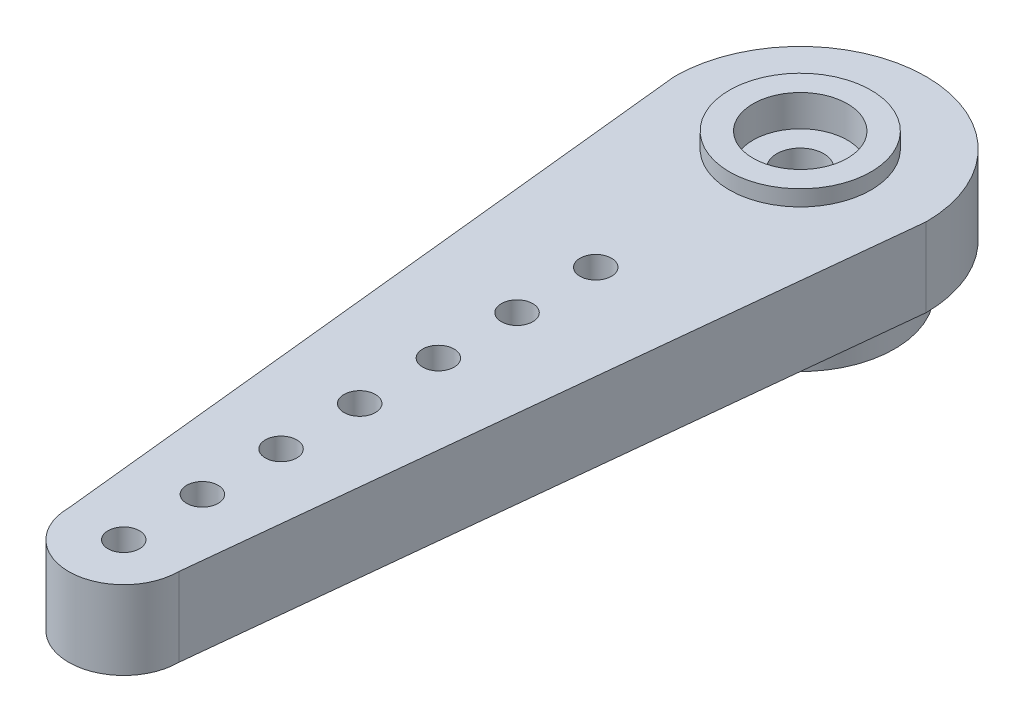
ISO-10303-21;
HEADER;
FILE_DESCRIPTION(('STEP AP214'),'2;1');
FILE_NAME('part.step','',(''),(''),'','','');
FILE_SCHEMA(('AUTOMOTIVE_DESIGN { 1 0 10303 214 1 1 1 1 }'));
ENDSEC;
DATA;
#1=APPLICATION_CONTEXT('core data for automotive mechanical design processes');
#2=APPLICATION_PROTOCOL_DEFINITION('international standard','automotive_design',2000,#1);
#3=PRODUCT_CONTEXT('',#1,'mechanical');
#4=PRODUCT('Part','Part','',(#3));
#5=PRODUCT_RELATED_PRODUCT_CATEGORY('part','',(#4));
#6=PRODUCT_DEFINITION_FORMATION('','',#4);
#7=PRODUCT_DEFINITION_CONTEXT('part definition',#1,'design');
#8=PRODUCT_DEFINITION('design','',#6,#7);
#9=PRODUCT_DEFINITION_SHAPE('','',#8);
#10=(LENGTH_UNIT() NAMED_UNIT(*) SI_UNIT(.MILLI.,.METRE.));
#11=(NAMED_UNIT(*) PLANE_ANGLE_UNIT() SI_UNIT($,.RADIAN.));
#12=(NAMED_UNIT(*) SI_UNIT($,.STERADIAN.) SOLID_ANGLE_UNIT());
#13=UNCERTAINTY_MEASURE_WITH_UNIT(LENGTH_MEASURE(1.E-05),#10,'distance_accuracy_value','');
#14=(GEOMETRIC_REPRESENTATION_CONTEXT(3) GLOBAL_UNCERTAINTY_ASSIGNED_CONTEXT((#13)) GLOBAL_UNIT_ASSIGNED_CONTEXT((#10,
#11,#12)) REPRESENTATION_CONTEXT('',''));
#15=CARTESIAN_POINT('',(0.,0.,0.));
#16=DIRECTION('',(0.,0.,1.));
#17=DIRECTION('',(1.,0.,0.));
#18=AXIS2_PLACEMENT_3D('',#15,#16,#17);
#19=CARTESIAN_POINT('',(0.,0.,0.));
#20=DIRECTION('',(0.,1.,0.));
#21=DIRECTION('',(0.,0.,1.));
#22=AXIS2_PLACEMENT_3D('',#19,#20,#21);
#23=CYLINDRICAL_SURFACE('',#22,1.5);
#24=CARTESIAN_POINT('',(0.,7.,0.));
#25=DIRECTION('',(0.,1.,0.));
#26=DIRECTION('',(0.,0.,1.));
#27=AXIS2_PLACEMENT_3D('',#24,#25,#26);
#28=CIRCLE('',#27,1.5);
#29=CARTESIAN_POINT('',(0.,7.,1.5));
#30=VERTEX_POINT('',#29);
#31=EDGE_CURVE('E522',#30,#30,#28,.T.);
#32=ORIENTED_EDGE('',*,*,#31,.T.);
#33=EDGE_LOOP('',(#32));
#34=FACE_BOUND('',#33,.T.);
#35=CARTESIAN_POINT('',(0.,5.,0.));
#36=DIRECTION('',(0.,-1.,0.));
#37=DIRECTION('',(0.,0.,-1.));
#38=AXIS2_PLACEMENT_3D('',#35,#36,#37);
#39=CIRCLE('',#38,1.5);
#40=CARTESIAN_POINT('',(0.,5.,-1.5));
#41=VERTEX_POINT('',#40);
#42=EDGE_CURVE('E366',#41,#41,#39,.T.);
#43=ORIENTED_EDGE('',*,*,#42,.T.);
#44=EDGE_LOOP('',(#43));
#45=FACE_BOUND('',#44,.T.);
#46=ADVANCED_FACE('F33',(#34,#45),#23,.F.);
#47=CARTESIAN_POINT('',(0.,8.,0.));
#48=DIRECTION('',(0.,1.,0.));
#49=DIRECTION('',(0.,0.,1.));
#50=AXIS2_PLACEMENT_3D('',#47,#48,#49);
#51=PLANE('',#50);
#52=CARTESIAN_POINT('',(3.14233320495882E-13,8.,43.));
#53=DIRECTION('',(0.,1.,0.));
#54=DIRECTION('',(0.,0.,1.));
#55=AXIS2_PLACEMENT_3D('',#52,#53,#54);
#56=CIRCLE('',#55,1.);
#57=CARTESIAN_POINT('',(3.14233320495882E-13,8.,44.));
#58=VERTEX_POINT('',#57);
#59=EDGE_CURVE('E495',#58,#58,#56,.T.);
#60=ORIENTED_EDGE('',*,*,#59,.F.);
#61=EDGE_LOOP('',(#60));
#62=FACE_BOUND('',#61,.T.);
#63=CARTESIAN_POINT('',(2.61861100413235E-13,8.,38.));
#64=DIRECTION('',(0.,1.,0.));
#65=DIRECTION('',(0.,0.,1.));
#66=AXIS2_PLACEMENT_3D('',#63,#64,#65);
#67=CIRCLE('',#66,1.);
#68=CARTESIAN_POINT('',(2.61861100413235E-13,8.,39.));
#69=VERTEX_POINT('',#68);
#70=EDGE_CURVE('E498',#69,#69,#67,.T.);
#71=ORIENTED_EDGE('',*,*,#70,.F.);
#72=EDGE_LOOP('',(#71));
#73=FACE_BOUND('',#72,.T.);
#74=CARTESIAN_POINT('',(2.09488880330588E-13,8.,33.));
#75=DIRECTION('',(0.,1.,0.));
#76=DIRECTION('',(0.,0.,1.));
#77=AXIS2_PLACEMENT_3D('',#74,#75,#76);
#78=CIRCLE('',#77,1.);
#79=CARTESIAN_POINT('',(2.09488880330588E-13,8.,34.));
#80=VERTEX_POINT('',#79);
#81=EDGE_CURVE('E502',#80,#80,#78,.T.);
#82=ORIENTED_EDGE('',*,*,#81,.F.);
#83=EDGE_LOOP('',(#82));
#84=FACE_BOUND('',#83,.T.);
#85=CARTESIAN_POINT('',(1.57116660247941E-13,8.,28.));
#86=DIRECTION('',(0.,1.,0.));
#87=DIRECTION('',(0.,0.,1.));
#88=AXIS2_PLACEMENT_3D('',#85,#86,#87);
#89=CIRCLE('',#88,1.);
#90=CARTESIAN_POINT('',(1.57116660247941E-13,8.,29.));
#91=VERTEX_POINT('',#90);
#92=EDGE_CURVE('E506',#91,#91,#89,.T.);
#93=ORIENTED_EDGE('',*,*,#92,.F.);
#94=EDGE_LOOP('',(#93));
#95=FACE_BOUND('',#94,.T.);
#96=CARTESIAN_POINT('',(1.04744440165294E-13,8.,23.));
#97=DIRECTION('',(0.,1.,0.));
#98=DIRECTION('',(0.,0.,1.));
#99=AXIS2_PLACEMENT_3D('',#96,#97,#98);
#100=CIRCLE('',#99,1.);
#101=CARTESIAN_POINT('',(1.04744440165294E-13,8.,24.));
#102=VERTEX_POINT('',#101);
#103=EDGE_CURVE('E510',#102,#102,#100,.T.);
#104=ORIENTED_EDGE('',*,*,#103,.F.);
#105=EDGE_LOOP('',(#104));
#106=FACE_BOUND('',#105,.T.);
#107=CARTESIAN_POINT('',(0.,8.,18.));
#108=DIRECTION('',(0.,1.,0.));
#109=DIRECTION('',(0.,0.,1.));
#110=AXIS2_PLACEMENT_3D('',#107,#108,#109);
#111=CIRCLE('',#110,1.);
#112=CARTESIAN_POINT('',(0.,8.,19.));
#113=VERTEX_POINT('',#112);
#114=EDGE_CURVE('E514',#113,#113,#111,.T.);
#115=ORIENTED_EDGE('',*,*,#114,.F.);
#116=EDGE_LOOP('',(#115));
#117=FACE_BOUND('',#116,.T.);
#118=CARTESIAN_POINT('',(0.,8.,13.));
#119=DIRECTION('',(0.,1.,0.));
#120=DIRECTION('',(0.,0.,1.));
#121=AXIS2_PLACEMENT_3D('',#118,#119,#120);
#122=CIRCLE('',#121,1.);
#123=CARTESIAN_POINT('',(0.,8.,14.));
#124=VERTEX_POINT('',#123);
#125=EDGE_CURVE('E518',#124,#124,#122,.T.);
#126=ORIENTED_EDGE('',*,*,#125,.F.);
#127=EDGE_LOOP('',(#126));
#128=FACE_BOUND('',#127,.T.);
#129=CARTESIAN_POINT('',(0.,8.,0.));
#130=DIRECTION('',(0.,1.,0.));
#131=DIRECTION('',(0.,0.,1.));
#132=AXIS2_PLACEMENT_3D('',#129,#130,#131);
#133=CIRCLE('',#132,8.);
#134=CARTESIAN_POINT('',(8.,8.,0.));
#135=VERTEX_POINT('',#134);
#136=CARTESIAN_POINT('',(-8.,8.,0.));
#137=VERTEX_POINT('',#136);
#138=EDGE_CURVE('E538',#135,#137,#133,.T.);
#139=ORIENTED_EDGE('',*,*,#138,.T.);
#140=DIRECTION('',(0.104082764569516,0.,0.994568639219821));
#141=VECTOR('',#140,1.);
#142=CARTESIAN_POINT('',(-8.,8.,0.));
#143=LINE('',#142,#141);
#144=CARTESIAN_POINT('',(-3.5,8.,43.));
#145=VERTEX_POINT('',#144);
#146=EDGE_CURVE('E541',#137,#145,#143,.T.);
#147=ORIENTED_EDGE('',*,*,#146,.T.);
#148=CARTESIAN_POINT('',(0.,8.,43.));
#149=DIRECTION('',(0.,1.,0.));
#150=DIRECTION('',(0.,0.,1.));
#151=AXIS2_PLACEMENT_3D('',#148,#149,#150);
#152=CIRCLE('',#151,3.5);
#153=CARTESIAN_POINT('',(3.5,8.,43.));
#154=VERTEX_POINT('',#153);
#155=EDGE_CURVE('E544',#145,#154,#152,.T.);
#156=ORIENTED_EDGE('',*,*,#155,.T.);
#157=DIRECTION('',(0.104082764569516,0.,-0.994568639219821));
#158=VECTOR('',#157,1.);
#159=CARTESIAN_POINT('',(8.,8.,0.));
#160=LINE('',#159,#158);
#161=EDGE_CURVE('E546',#154,#135,#160,.T.);
#162=ORIENTED_EDGE('',*,*,#161,.T.);
#163=EDGE_LOOP('',(#139,#147,#156,#162));
#164=FACE_BOUND('',#163,.T.);
#165=CARTESIAN_POINT('',(0.,8.,0.));
#166=DIRECTION('',(0.,1.,0.));
#167=DIRECTION('',(0.,0.,1.));
#168=AXIS2_PLACEMENT_3D('',#165,#166,#167);
#169=CIRCLE('',#168,4.5);
#170=CARTESIAN_POINT('',(0.,8.,4.5));
#171=VERTEX_POINT('',#170);
#172=EDGE_CURVE('E529',#171,#171,#169,.T.);
#173=ORIENTED_EDGE('',*,*,#172,.F.);
#174=EDGE_LOOP('',(#173));
#175=FACE_BOUND('',#174,.T.);
#176=ADVANCED_FACE('F816',(#62,#73,#84,#95,#106,#117,#128,#164,#175),#51,.T.);
#177=CARTESIAN_POINT('',(0.,0.,0.));
#178=DIRECTION('',(0.,1.,0.));
#179=DIRECTION('',(0.,0.,1.));
#180=AXIS2_PLACEMENT_3D('',#177,#178,#179);
#181=PLANE('',#180);
#182=CARTESIAN_POINT('',(0.,0.,0.));
#183=DIRECTION('',(0.,1.,0.));
#184=DIRECTION('',(0.,0.,1.));
#185=AXIS2_PLACEMENT_3D('',#182,#183,#184);
#186=CIRCLE('',#185,6.);
#187=CARTESIAN_POINT('',(0.,0.,6.));
#188=VERTEX_POINT('',#187);
#189=EDGE_CURVE('E42',#188,#188,#186,.T.);
#190=ORIENTED_EDGE('',*,*,#189,.F.);
#191=EDGE_LOOP('',(#190));
#192=FACE_BOUND('',#191,.T.);
#193=CARTESIAN_POINT('',(0.,0.,0.));
#194=DIRECTION('',(0.,-1.,0.));
#195=DIRECTION('',(0.,0.,-1.));
#196=AXIS2_PLACEMENT_3D('',#193,#194,#195);
#197=CIRCLE('',#196,3.75);
#198=CARTESIAN_POINT('',(-0.858971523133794,0.,3.65029696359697));
#199=VERTEX_POINT('',#198);
#200=CARTESIAN_POINT('',(-0.699999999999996,0.,3.68408740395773));
#201=VERTEX_POINT('',#200);
#202=EDGE_CURVE('E50',#199,#201,#197,.F.);
#203=ORIENTED_EDGE('',*,*,#202,.T.);
#204=DIRECTION('',(-0.741138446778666,0.,0.671352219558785));
#205=VECTOR('',#204,1.);
#206=CARTESIAN_POINT('',(1.51757307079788,0.,1.67532290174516));
#207=LINE('',#206,#205);
#208=CARTESIAN_POINT('',(0.,0.,3.05));
#209=VERTEX_POINT('',#208);
#210=EDGE_CURVE('E352',#209,#201,#207,.T.);
#211=ORIENTED_EDGE('',*,*,#210,.F.);
#212=DIRECTION('',(0.741138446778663,0.,0.671352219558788));
#213=VECTOR('',#212,1.);
#214=CARTESIAN_POINT('',(-1.51757307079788,0.,1.67532290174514));
#215=LINE('',#214,#213);
#216=CARTESIAN_POINT('',(0.699999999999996,0.,3.68408740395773));
#217=VERTEX_POINT('',#216);
#218=EDGE_CURVE('E693',#209,#217,#215,.T.);
#219=ORIENTED_EDGE('',*,*,#218,.T.);
#220=CARTESIAN_POINT('',(0.,0.,0.));
#221=DIRECTION('',(0.,-1.,0.));
#222=DIRECTION('',(0.,0.,-1.));
#223=AXIS2_PLACEMENT_3D('',#220,#221,#222);
#224=CIRCLE('',#223,3.75);
#225=CARTESIAN_POINT('',(0.85897152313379,0.,3.65029696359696));
#226=VERTEX_POINT('',#225);
#227=EDGE_CURVE('E690',#217,#226,#224,.F.);
#228=ORIENTED_EDGE('',*,*,#227,.T.);
#229=DIRECTION('',(-0.404000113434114,0.,0.914758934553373));
#230=VECTOR('',#229,1.);
#231=CARTESIAN_POINT('',(2.06778719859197,0.,0.913231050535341));
#232=LINE('',#231,#230);
#233=CARTESIAN_POINT('',(1.24054676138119,0.,2.78631364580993));
#234=VERTEX_POINT('',#233);
#235=EDGE_CURVE('E687',#234,#226,#232,.T.);
#236=ORIENTED_EDGE('',*,*,#235,.F.);
#237=DIRECTION('',(0.950127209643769,0.,0.311862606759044));
#238=VECTOR('',#237,1.);
#239=CARTESIAN_POINT('',(-0.704956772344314,0.,2.14773620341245));
#240=LINE('',#239,#238);
#241=CARTESIAN_POINT('',(2.13793516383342,0.,3.08086566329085));
#242=VERTEX_POINT('',#241);
#243=EDGE_CURVE('E684',#234,#242,#240,.T.);
#244=ORIENTED_EDGE('',*,*,#243,.T.);
#245=CARTESIAN_POINT('',(0.,0.,0.));
#246=DIRECTION('',(0.,-1.,0.));
#247=DIRECTION('',(0.,0.,-1.));
#248=AXIS2_PLACEMENT_3D('',#245,#246,#247);
#249=CIRCLE('',#248,3.75);
#250=CARTESIAN_POINT('',(2.26941906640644,0.,2.98533701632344));
#251=VERTEX_POINT('',#250);
#252=EDGE_CURVE('E681',#242,#251,#249,.F.);
#253=ORIENTED_EDGE('',*,*,#252,.T.);
#254=DIRECTION('',(0.00299350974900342,0.,0.999995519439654));
#255=VECTOR('',#254,1.);
#256=CARTESIAN_POINT('',(2.26046213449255,0.,-0.00676674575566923));
#257=LINE('',#256,#255);
#258=CARTESIAN_POINT('',(2.26659171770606,0.,2.04084834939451));
#259=VERTEX_POINT('',#258);
#260=EDGE_CURVE('E678',#259,#251,#257,.T.);
#261=ORIENTED_EDGE('',*,*,#260,.F.);
#262=DIRECTION('',(0.994830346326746,0.,-0.101550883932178));
#263=VECTOR('',#262,1.);
#264=CARTESIAN_POINT('',(0.229552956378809,0.,2.24878640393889));
#265=LINE('',#264,#263);
#266=CARTESIAN_POINT('',(3.20620191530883,0.,1.94493426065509));
#267=VERTEX_POINT('',#266);
#268=EDGE_CURVE('E675',#259,#267,#265,.T.);
#269=ORIENTED_EDGE('',*,*,#268,.T.);
#270=CARTESIAN_POINT('',(0.,0.,0.));
#271=DIRECTION('',(0.,-1.,0.));
#272=DIRECTION('',(0.,0.,-1.));
#273=AXIS2_PLACEMENT_3D('',#270,#271,#272);
#274=CIRCLE('',#273,3.75);
#275=CARTESIAN_POINT('',(3.28746343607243,0.,1.80418517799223));
#276=VERTEX_POINT('',#275);
#277=EDGE_CURVE('E672',#267,#276,#274,.F.);
#278=ORIENTED_EDGE('',*,*,#277,.T.);
#279=DIRECTION('',(0.409469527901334,0.,0.912323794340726));
#280=VECTOR('',#279,1.);
#281=CARTESIAN_POINT('',(2.06228263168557,0.,-0.925594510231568));
#282=LINE('',#281,#280);
#283=CARTESIAN_POINT('',(2.90072237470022,0.,0.942501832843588));
#284=VERTEX_POINT('',#283);
#285=EDGE_CURVE('E669',#284,#276,#282,.T.);
#286=ORIENTED_EDGE('',*,*,#285,.F.);
#287=DIRECTION('',(0.867518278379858,0.,-0.497405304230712));
#288=VECTOR('',#287,1.);
#289=CARTESIAN_POINT('',(1.12437089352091,0.,1.96100100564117));
#290=LINE('',#289,#288);
#291=CARTESIAN_POINT('',(3.72008722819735,0.,0.472706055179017));
#292=VERTEX_POINT('',#291);
#293=EDGE_CURVE('E666',#284,#292,#290,.T.);
#294=ORIENTED_EDGE('',*,*,#293,.T.);
#295=CARTESIAN_POINT('',(0.,0.,0.));
#296=DIRECTION('',(0.,-1.,0.));
#297=DIRECTION('',(0.,0.,-1.));
#298=AXIS2_PLACEMENT_3D('',#295,#296,#297);
#299=CIRCLE('',#298,3.75);
#300=CARTESIAN_POINT('',(3.73707551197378,0.,0.311073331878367));
#301=VERTEX_POINT('',#300);
#302=EDGE_CURVE('E663',#292,#301,#299,.F.);
#303=ORIENTED_EDGE('',*,*,#302,.T.);
#304=DIRECTION('',(0.745144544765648,0.,0.66690299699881));
#305=VECTOR('',#304,1.);
#306=CARTESIAN_POINT('',(1.5075157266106,0.,-1.68437857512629));
#307=LINE('',#306,#305);
#308=CARTESIAN_POINT('',(3.03329178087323,0.,-0.318811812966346));
#309=VERTEX_POINT('',#308);
#310=EDGE_CURVE('E660',#309,#301,#307,.T.);
#311=ORIENTED_EDGE('',*,*,#310,.F.);
#312=DIRECTION('',(0.590204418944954,0.,-0.807253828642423));
#313=VECTOR('',#312,1.);
#314=CARTESIAN_POINT('',(1.82477488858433,0.,1.33414071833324));
#315=LINE('',#314,#313);
#316=CARTESIAN_POINT('',(3.59073566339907,0.,-1.0812573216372));
#317=VERTEX_POINT('',#316);
#318=EDGE_CURVE('E657',#309,#317,#315,.T.);
#319=ORIENTED_EDGE('',*,*,#318,.T.);
#320=CARTESIAN_POINT('',(0.,0.,0.));
#321=DIRECTION('',(0.,-1.,0.));
#322=DIRECTION('',(0.,0.,-1.));
#323=AXIS2_PLACEMENT_3D('',#320,#321,#322);
#324=CIRCLE('',#323,3.75);
#325=CARTESIAN_POINT('',(3.54051328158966,0.,-1.23582591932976));
#326=VERTEX_POINT('',#325);
#327=EDGE_CURVE('E654',#317,#326,#324,.F.);
#328=ORIENTED_EDGE('',*,*,#327,.T.);
#329=DIRECTION('',(0.951977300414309,0.,0.306168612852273));
#330=VECTOR('',#329,1.);
#331=CARTESIAN_POINT('',(0.692085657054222,0.,-2.1519182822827));
#332=LINE('',#331,#330);
#333=CARTESIAN_POINT('',(2.64137748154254,0.,-1.525));
#334=VERTEX_POINT('',#333);
#335=EDGE_CURVE('E651',#334,#326,#332,.T.);
#336=ORIENTED_EDGE('',*,*,#335,.F.);
#337=DIRECTION('',(0.210838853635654,0.,-0.977520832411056));
#338=VECTOR('',#337,1.);
#339=CARTESIAN_POINT('',(2.20965872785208,0.,0.476595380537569));
#340=LINE('',#339,#338);
#341=CARTESIAN_POINT('',(2.84051328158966,0.,-2.44826148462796));
#342=VERTEX_POINT('',#341);
#343=EDGE_CURVE('E648',#334,#342,#340,.T.);
#344=ORIENTED_EDGE('',*,*,#343,.T.);
#345=CARTESIAN_POINT('',(0.,0.,0.));
#346=DIRECTION('',(0.,-1.,0.));
#347=DIRECTION('',(0.,0.,-1.));
#348=AXIS2_PLACEMENT_3D('',#345,#346,#347);
#349=CIRCLE('',#348,3.75);
#350=CARTESIAN_POINT('',(2.73176414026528,0.,-2.56903964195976));
#351=VERTEX_POINT('',#350);
#352=EDGE_CURVE('E645',#342,#351,#349,.F.);
#353=ORIENTED_EDGE('',*,*,#352,.T.);
#354=DIRECTION('',(0.994204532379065,0.,-0.107505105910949));
#355=VECTOR('',#354,1.);
#356=CARTESIAN_POINT('',(-0.24301231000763,0.,-2.24737176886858));
#357=LINE('',#356,#355);
#358=CARTESIAN_POINT('',(1.79274501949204,0.,-2.46750183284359));
#359=VERTEX_POINT('',#358);
#360=EDGE_CURVE('E642',#359,#351,#357,.T.);
#361=ORIENTED_EDGE('',*,*,#360,.F.);
#362=DIRECTION('',(-0.204982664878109,0.,-0.97876560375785));
#363=VECTOR('',#362,1.);
#364=CARTESIAN_POINT('',(2.21247249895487,0.,-0.46335762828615));
#365=LINE('',#364,#363);
#366=CARTESIAN_POINT('',(1.59914034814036,0.,-3.39193899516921));
#367=VERTEX_POINT('',#366);
#368=EDGE_CURVE('E639',#359,#367,#365,.T.);
#369=ORIENTED_EDGE('',*,*,#368,.T.);
#370=CARTESIAN_POINT('',(0.,0.,0.));
#371=DIRECTION('',(0.,-1.,0.));
#372=DIRECTION('',(0.,0.,-1.));
#373=AXIS2_PLACEMENT_3D('',#370,#371,#372);
#374=CIRCLE('',#373,3.75);
#375=CARTESIAN_POINT('',(1.45066816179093,0.,-3.45804307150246));
#376=VERTEX_POINT('',#375);
#377=EDGE_CURVE('E636',#367,#376,#374,.F.);
#378=ORIENTED_EDGE('',*,*,#377,.T.);
#379=DIRECTION('',(0.864524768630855,0.,-0.502590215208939));
#380=VECTOR('',#379,1.);
#381=CARTESIAN_POINT('',(-1.13609124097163,0.,-1.95423425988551));
#382=LINE('',#381,#380);
#383=CARTESIAN_POINT('',(0.634130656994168,0.,-2.98335018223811));
#384=VERTEX_POINT('',#383);
#385=EDGE_CURVE('E633',#384,#376,#382,.T.);
#386=ORIENTED_EDGE('',*,*,#385,.F.);
#387=DIRECTION('',(-0.585360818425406,0.,-0.810772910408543));
#388=VECTOR('',#387,1.);
#389=CARTESIAN_POINT('',(1.83272967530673,0.,-1.32319189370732));
#390=LINE('',#389,#388);
#391=CARTESIAN_POINT('',(0.0812615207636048,0.,-3.74911943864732));
#392=VERTEX_POINT('',#391);
#393=EDGE_CURVE('E630',#384,#392,#390,.T.);
#394=ORIENTED_EDGE('',*,*,#393,.T.);
#395=CARTESIAN_POINT('',(0.,0.,0.));
#396=DIRECTION('',(0.,-1.,0.));
#397=DIRECTION('',(0.,0.,-1.));
#398=AXIS2_PLACEMENT_3D('',#395,#396,#397);
#399=CIRCLE('',#398,3.75);
#400=CARTESIAN_POINT('',(-0.0812615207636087,0.,-3.74911943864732));
#401=VERTEX_POINT('',#400);
#402=EDGE_CURVE('E627',#392,#401,#399,.F.);
#403=ORIENTED_EDGE('',*,*,#402,.T.);
#404=DIRECTION('',(0.585360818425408,0.,-0.810772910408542));
#405=VECTOR('',#404,1.);
#406=CARTESIAN_POINT('',(-1.83272967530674,0.,-1.32319189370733));
#407=LINE('',#406,#405);
#408=CARTESIAN_POINT('',(-0.634130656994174,0.,-2.98335018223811));
#409=VERTEX_POINT('',#408);
#410=EDGE_CURVE('E624',#409,#401,#407,.T.);
#411=ORIENTED_EDGE('',*,*,#410,.F.);
#412=DIRECTION('',(-0.864524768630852,0.,-0.502590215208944));
#413=VECTOR('',#412,1.);
#414=CARTESIAN_POINT('',(1.13609124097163,0.,-1.95423425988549));
#415=LINE('',#414,#413);
#416=CARTESIAN_POINT('',(-1.45066816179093,0.,-3.45804307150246));
#417=VERTEX_POINT('',#416);
#418=EDGE_CURVE('E621',#409,#417,#415,.T.);
#419=ORIENTED_EDGE('',*,*,#418,.T.);
#420=CARTESIAN_POINT('',(0.,0.,0.));
#421=DIRECTION('',(0.,-1.,0.));
#422=DIRECTION('',(0.,0.,-1.));
#423=AXIS2_PLACEMENT_3D('',#420,#421,#422);
#424=CIRCLE('',#423,3.75);
#425=CARTESIAN_POINT('',(-1.59914034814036,0.,-3.39193899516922));
#426=VERTEX_POINT('',#425);
#427=EDGE_CURVE('E618',#417,#426,#424,.F.);
#428=ORIENTED_EDGE('',*,*,#427,.T.);
#429=DIRECTION('',(0.204982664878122,0.,-0.978765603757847));
#430=VECTOR('',#429,1.);
#431=CARTESIAN_POINT('',(-2.2124724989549,0.,-0.463357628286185));
#432=LINE('',#431,#430);
#433=CARTESIAN_POINT('',(-1.79274501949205,0.,-2.46750183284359));
#434=VERTEX_POINT('',#433);
#435=EDGE_CURVE('E615',#434,#426,#432,.T.);
#436=ORIENTED_EDGE('',*,*,#435,.F.);
#437=DIRECTION('',(-0.994204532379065,0.,-0.107505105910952));
#438=VECTOR('',#437,1.);
#439=CARTESIAN_POINT('',(0.243012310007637,0.,-2.24737176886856));
#440=LINE('',#439,#438);
#441=CARTESIAN_POINT('',(-2.73176414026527,0.,-2.56903964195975));
#442=VERTEX_POINT('',#441);
#443=EDGE_CURVE('E612',#434,#442,#440,.T.);
#444=ORIENTED_EDGE('',*,*,#443,.T.);
#445=CARTESIAN_POINT('',(0.,0.,0.));
#446=DIRECTION('',(0.,-1.,0.));
#447=DIRECTION('',(0.,0.,-1.));
#448=AXIS2_PLACEMENT_3D('',#445,#446,#447);
#449=CIRCLE('',#448,3.75);
#450=CARTESIAN_POINT('',(-2.84051328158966,0.,-2.44826148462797));
#451=VERTEX_POINT('',#450);
#452=EDGE_CURVE('E609',#442,#451,#449,.F.);
#453=ORIENTED_EDGE('',*,*,#452,.T.);
#454=DIRECTION('',(-0.210838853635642,0.,-0.977520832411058));
#455=VECTOR('',#454,1.);
#456=CARTESIAN_POINT('',(-2.20965872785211,0.,0.476595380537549));
#457=LINE('',#456,#455);
#458=CARTESIAN_POINT('',(-2.64137748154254,0.,-1.525));
#459=VERTEX_POINT('',#458);
#460=EDGE_CURVE('E606',#459,#451,#457,.T.);
#461=ORIENTED_EDGE('',*,*,#460,.F.);
#462=DIRECTION('',(-0.951977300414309,0.,0.306168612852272));
#463=VECTOR('',#462,1.);
#464=CARTESIAN_POINT('',(-0.692085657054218,0.,-2.1519182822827));
#465=LINE('',#464,#463);
#466=CARTESIAN_POINT('',(-3.54051328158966,0.,-1.23582591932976));
#467=VERTEX_POINT('',#466);
#468=EDGE_CURVE('E603',#459,#467,#465,.T.);
#469=ORIENTED_EDGE('',*,*,#468,.T.);
#470=CARTESIAN_POINT('',(0.,0.,0.));
#471=DIRECTION('',(0.,-1.,0.));
#472=DIRECTION('',(0.,0.,-1.));
#473=AXIS2_PLACEMENT_3D('',#470,#471,#472);
#474=CIRCLE('',#473,3.75);
#475=CARTESIAN_POINT('',(-3.59073566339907,0.,-1.08125732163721));
#476=VERTEX_POINT('',#475);
#477=EDGE_CURVE('E600',#467,#476,#474,.F.);
#478=ORIENTED_EDGE('',*,*,#477,.T.);
#479=DIRECTION('',(-0.590204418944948,0.,-0.807253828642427));
#480=VECTOR('',#479,1.);
#481=CARTESIAN_POINT('',(-1.82477488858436,0.,1.33414071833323));
#482=LINE('',#481,#480);
#483=CARTESIAN_POINT('',(-3.03329178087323,0.,-0.318811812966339));
#484=VERTEX_POINT('',#483);
#485=EDGE_CURVE('E597',#484,#476,#482,.T.);
#486=ORIENTED_EDGE('',*,*,#485,.F.);
#487=DIRECTION('',(-0.745144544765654,0.,0.666902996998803));
#488=VECTOR('',#487,1.);
#489=CARTESIAN_POINT('',(-1.50751572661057,0.,-1.68437857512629));
#490=LINE('',#489,#488);
#491=CARTESIAN_POINT('',(-3.73707551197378,0.,0.311073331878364));
#492=VERTEX_POINT('',#491);
#493=EDGE_CURVE('E594',#484,#492,#490,.T.);
#494=ORIENTED_EDGE('',*,*,#493,.T.);
#495=CARTESIAN_POINT('',(0.,0.,0.));
#496=DIRECTION('',(0.,-1.,0.));
#497=DIRECTION('',(0.,0.,-1.));
#498=AXIS2_PLACEMENT_3D('',#495,#496,#497);
#499=CIRCLE('',#498,3.75);
#500=CARTESIAN_POINT('',(-3.72008722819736,0.,0.472706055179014));
#501=VERTEX_POINT('',#500);
#502=EDGE_CURVE('E591',#492,#501,#499,.F.);
#503=ORIENTED_EDGE('',*,*,#502,.T.);
#504=DIRECTION('',(-0.867518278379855,0.,-0.497405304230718));
#505=VECTOR('',#504,1.);
#506=CARTESIAN_POINT('',(-1.12437089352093,0.,1.96100100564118));
#507=LINE('',#506,#505);
#508=CARTESIAN_POINT('',(-2.90072237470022,0.,0.942501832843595));
#509=VERTEX_POINT('',#508);
#510=EDGE_CURVE('E588',#509,#501,#507,.T.);
#511=ORIENTED_EDGE('',*,*,#510,.F.);
#512=DIRECTION('',(-0.409469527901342,0.,0.912323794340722));
#513=VECTOR('',#512,1.);
#514=CARTESIAN_POINT('',(-2.06228263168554,0.,-0.925594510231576));
#515=LINE('',#514,#513);
#516=CARTESIAN_POINT('',(-3.28746343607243,0.,1.80418517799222));
#517=VERTEX_POINT('',#516);
#518=EDGE_CURVE('E585',#509,#517,#515,.T.);
#519=ORIENTED_EDGE('',*,*,#518,.T.);
#520=CARTESIAN_POINT('',(0.,0.,0.));
#521=DIRECTION('',(0.,-1.,0.));
#522=DIRECTION('',(0.,0.,-1.));
#523=AXIS2_PLACEMENT_3D('',#520,#521,#522);
#524=CIRCLE('',#523,3.75);
#525=CARTESIAN_POINT('',(-3.20620191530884,0.,1.94493426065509));
#526=VERTEX_POINT('',#525);
#527=EDGE_CURVE('E582',#517,#526,#524,.F.);
#528=ORIENTED_EDGE('',*,*,#527,.T.);
#529=DIRECTION('',(-0.994830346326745,0.,-0.101550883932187));
#530=VECTOR('',#529,1.);
#531=CARTESIAN_POINT('',(-0.22955295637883,0.,2.24878640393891));
#532=LINE('',#531,#530);
#533=CARTESIAN_POINT('',(-2.26659171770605,0.,2.04084834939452));
#534=VERTEX_POINT('',#533);
#535=EDGE_CURVE('E579',#534,#526,#532,.T.);
#536=ORIENTED_EDGE('',*,*,#535,.F.);
#537=DIRECTION('',(-0.00299350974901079,0.,0.999995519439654));
#538=VECTOR('',#537,1.);
#539=CARTESIAN_POINT('',(-2.26046213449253,0.,-0.00676674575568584));
#540=LINE('',#539,#538);
#541=CARTESIAN_POINT('',(-2.26941906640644,0.,2.98533701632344));
#542=VERTEX_POINT('',#541);
#543=EDGE_CURVE('E576',#534,#542,#540,.T.);
#544=ORIENTED_EDGE('',*,*,#543,.T.);
#545=CARTESIAN_POINT('',(0.,0.,0.));
#546=DIRECTION('',(0.,-1.,0.));
#547=DIRECTION('',(0.,0.,-1.));
#548=AXIS2_PLACEMENT_3D('',#545,#546,#547);
#549=CIRCLE('',#548,3.75);
#550=CARTESIAN_POINT('',(-2.13793516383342,0.,3.08086566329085));
#551=VERTEX_POINT('',#550);
#552=EDGE_CURVE('E573',#542,#551,#549,.F.);
#553=ORIENTED_EDGE('',*,*,#552,.T.);
#554=DIRECTION('',(-0.950127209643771,0.,0.311862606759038));
#555=VECTOR('',#554,1.);
#556=CARTESIAN_POINT('',(0.704956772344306,0.,2.14773620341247));
#557=LINE('',#556,#555);
#558=CARTESIAN_POINT('',(-1.24054676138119,0.,2.78631364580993));
#559=VERTEX_POINT('',#558);
#560=EDGE_CURVE('E570',#559,#551,#557,.T.);
#561=ORIENTED_EDGE('',*,*,#560,.F.);
#562=DIRECTION('',(0.404000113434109,0.,0.914758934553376));
#563=VECTOR('',#562,1.);
#564=CARTESIAN_POINT('',(-2.06778719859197,0.,0.913231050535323));
#565=LINE('',#564,#563);
#566=EDGE_CURVE('E568',#559,#199,#565,.T.);
#567=ORIENTED_EDGE('',*,*,#566,.T.);
#568=EDGE_LOOP('',(#203,#211,#219,#228,#236,#244,#253,#261,#269,#278,#286,#294,#303,#311,#319,
#328,#336,#344,#353,#361,#369,#378,#386,#394,#403,#411,#419,#428,#436,#444,#453,#461,#469,#478,
#486,#494,#503,#511,#519,#528,#536,#544,#553,#561,#567));
#569=FACE_BOUND('',#568,.T.);
#570=ADVANCED_FACE('F822',(#192,#569),#181,.F.);
#571=CARTESIAN_POINT('',(0.,3.,0.));
#572=DIRECTION('',(0.,-1.,0.));
#573=DIRECTION('',(0.,0.,-1.));
#574=AXIS2_PLACEMENT_3D('',#571,#572,#573);
#575=CYLINDRICAL_SURFACE('',#574,6.);
#576=CARTESIAN_POINT('',(0.,3.,0.));
#577=DIRECTION('',(0.,1.,0.));
#578=DIRECTION('',(0.,0.,1.));
#579=AXIS2_PLACEMENT_3D('',#576,#577,#578);
#580=CIRCLE('',#579,6.);
#581=CARTESIAN_POINT('',(0.,3.,6.));
#582=VERTEX_POINT('',#581);
#583=EDGE_CURVE('E11',#582,#582,#580,.T.);
#584=ORIENTED_EDGE('',*,*,#583,.F.);
#585=EDGE_LOOP('',(#584));
#586=FACE_BOUND('',#585,.T.);
#587=ORIENTED_EDGE('',*,*,#189,.T.);
#588=EDGE_LOOP('',(#587));
#589=FACE_BOUND('',#588,.T.);
#590=ADVANCED_FACE('F35',(#586,#589),#575,.T.);
#591=CARTESIAN_POINT('',(0.,3.,0.));
#592=DIRECTION('',(0.,-1.,0.));
#593=DIRECTION('',(0.,0.,-1.));
#594=AXIS2_PLACEMENT_3D('',#591,#592,#593);
#595=CYLINDRICAL_SURFACE('',#594,3.75);
#596=ORIENTED_EDGE('',*,*,#202,.F.);
#597=DIRECTION('',(0.,-1.,0.));
#598=VECTOR('',#597,1.);
#599=CARTESIAN_POINT('',(-0.858971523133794,3.,3.65029696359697));
#600=LINE('',#599,#598);
#601=CARTESIAN_POINT('',(-0.858971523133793,5.,3.65029696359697));
#602=VERTEX_POINT('',#601);
#603=EDGE_CURVE('E342',#602,#199,#600,.T.);
#604=ORIENTED_EDGE('',*,*,#603,.F.);
#605=CARTESIAN_POINT('',(0.,5.,0.));
#606=DIRECTION('',(0.,-1.,0.));
#607=DIRECTION('',(0.,0.,-1.));
#608=AXIS2_PLACEMENT_3D('',#605,#606,#607);
#609=CIRCLE('',#608,3.75);
#610=CARTESIAN_POINT('',(-0.699999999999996,5.,3.68408740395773));
#611=VERTEX_POINT('',#610);
#612=EDGE_CURVE('E346',#611,#602,#609,.T.);
#613=ORIENTED_EDGE('',*,*,#612,.F.);
#614=DIRECTION('',(0.,-1.,0.));
#615=VECTOR('',#614,1.);
#616=CARTESIAN_POINT('',(-0.699999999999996,3.,3.68408740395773));
#617=LINE('',#616,#615);
#618=EDGE_CURVE('E55',#611,#201,#617,.T.);
#619=ORIENTED_EDGE('',*,*,#618,.T.);
#620=EDGE_LOOP('',(#596,#604,#613,#619));
#621=FACE_BOUND('',#620,.T.);
#622=ADVANCED_FACE('F344',(#621),#595,.F.);
#623=CARTESIAN_POINT('',(1.51757307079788,3.,1.67532290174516));
#624=DIRECTION('',(0.671352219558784,0.,0.741138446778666));
#625=DIRECTION('',(0.741138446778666,0.,-0.671352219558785));
#626=AXIS2_PLACEMENT_3D('',#623,#624,#625);
#627=PLANE('',#626);
#628=ORIENTED_EDGE('',*,*,#210,.T.);
#629=ORIENTED_EDGE('',*,*,#618,.F.);
#630=DIRECTION('',(-0.741138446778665,0.,0.671352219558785));
#631=VECTOR('',#630,1.);
#632=CARTESIAN_POINT('',(0.,5.,3.05));
#633=LINE('',#632,#631);
#634=CARTESIAN_POINT('',(0.,5.,3.05));
#635=VERTEX_POINT('',#634);
#636=EDGE_CURVE('E365',#635,#611,#633,.T.);
#637=ORIENTED_EDGE('',*,*,#636,.F.);
#638=DIRECTION('',(0.,-1.,0.));
#639=VECTOR('',#638,1.);
#640=CARTESIAN_POINT('',(0.,3.,3.05));
#641=LINE('',#640,#639);
#642=EDGE_CURVE('E698',#635,#209,#641,.T.);
#643=ORIENTED_EDGE('',*,*,#642,.T.);
#644=EDGE_LOOP('',(#628,#629,#637,#643));
#645=FACE_BOUND('',#644,.T.);
#646=ADVANCED_FACE('F865',(#645),#627,.F.);
#647=CARTESIAN_POINT('',(-1.51757307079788,3.,1.67532290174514));
#648=DIRECTION('',(0.671352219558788,0.,-0.741138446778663));
#649=DIRECTION('',(-0.741138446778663,0.,-0.671352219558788));
#650=AXIS2_PLACEMENT_3D('',#647,#648,#649);
#651=PLANE('',#650);
#652=ORIENTED_EDGE('',*,*,#218,.F.);
#653=ORIENTED_EDGE('',*,*,#642,.F.);
#654=DIRECTION('',(-0.741138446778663,0.,-0.671352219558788));
#655=VECTOR('',#654,1.);
#656=CARTESIAN_POINT('',(0.699999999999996,5.,3.68408740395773));
#657=LINE('',#656,#655);
#658=CARTESIAN_POINT('',(0.699999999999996,5.,3.68408740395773));
#659=VERTEX_POINT('',#658);
#660=EDGE_CURVE('E492',#659,#635,#657,.T.);
#661=ORIENTED_EDGE('',*,*,#660,.F.);
#662=DIRECTION('',(0.,-1.,0.));
#663=VECTOR('',#662,1.);
#664=CARTESIAN_POINT('',(0.699999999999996,3.,3.68408740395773));
#665=LINE('',#664,#663);
#666=EDGE_CURVE('E700',#659,#217,#665,.T.);
#667=ORIENTED_EDGE('',*,*,#666,.T.);
#668=EDGE_LOOP('',(#652,#653,#661,#667));
#669=FACE_BOUND('',#668,.T.);
#670=ADVANCED_FACE('F868',(#669),#651,.T.);
#671=CARTESIAN_POINT('',(0.,3.,0.));
#672=DIRECTION('',(0.,-1.,0.));
#673=DIRECTION('',(0.,0.,-1.));
#674=AXIS2_PLACEMENT_3D('',#671,#672,#673);
#675=CYLINDRICAL_SURFACE('',#674,3.75);
#676=ORIENTED_EDGE('',*,*,#227,.F.);
#677=ORIENTED_EDGE('',*,*,#666,.F.);
#678=CARTESIAN_POINT('',(0.,5.,0.));
#679=DIRECTION('',(0.,-1.,0.));
#680=DIRECTION('',(0.,0.,-1.));
#681=AXIS2_PLACEMENT_3D('',#678,#679,#680);
#682=CIRCLE('',#681,3.75);
#683=CARTESIAN_POINT('',(0.85897152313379,5.,3.65029696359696));
#684=VERTEX_POINT('',#683);
#685=EDGE_CURVE('E489',#684,#659,#682,.T.);
#686=ORIENTED_EDGE('',*,*,#685,.F.);
#687=DIRECTION('',(0.,-1.,0.));
#688=VECTOR('',#687,1.);
#689=CARTESIAN_POINT('',(0.85897152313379,3.,3.65029696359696));
#690=LINE('',#689,#688);
#691=EDGE_CURVE('E702',#684,#226,#690,.T.);
#692=ORIENTED_EDGE('',*,*,#691,.T.);
#693=EDGE_LOOP('',(#676,#677,#686,#692));
#694=FACE_BOUND('',#693,.T.);
#695=ADVANCED_FACE('F872',(#694),#675,.F.);
#696=CARTESIAN_POINT('',(2.06778719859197,3.,0.913231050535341));
#697=DIRECTION('',(0.914758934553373,0.,0.404000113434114));
#698=DIRECTION('',(0.404000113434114,0.,-0.914758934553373));
#699=AXIS2_PLACEMENT_3D('',#696,#697,#698);
#700=PLANE('',#699);
#701=ORIENTED_EDGE('',*,*,#235,.T.);
#702=ORIENTED_EDGE('',*,*,#691,.F.);
#703=DIRECTION('',(-0.404000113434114,0.,0.914758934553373));
#704=VECTOR('',#703,1.);
#705=CARTESIAN_POINT('',(1.24054676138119,5.,2.78631364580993));
#706=LINE('',#705,#704);
#707=CARTESIAN_POINT('',(1.24054676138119,5.,2.78631364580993));
#708=VERTEX_POINT('',#707);
#709=EDGE_CURVE('E486',#708,#684,#706,.T.);
#710=ORIENTED_EDGE('',*,*,#709,.F.);
#711=DIRECTION('',(0.,-1.,0.));
#712=VECTOR('',#711,1.);
#713=CARTESIAN_POINT('',(1.24054676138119,3.,2.78631364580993));
#714=LINE('',#713,#712);
#715=EDGE_CURVE('E704',#708,#234,#714,.T.);
#716=ORIENTED_EDGE('',*,*,#715,.T.);
#717=EDGE_LOOP('',(#701,#702,#710,#716));
#718=FACE_BOUND('',#717,.T.);
#719=ADVANCED_FACE('F876',(#718),#700,.F.);
#720=CARTESIAN_POINT('',(-0.704956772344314,3.,2.14773620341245));
#721=DIRECTION('',(0.311862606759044,0.,-0.950127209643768));
#722=DIRECTION('',(-0.950127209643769,0.,-0.311862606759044));
#723=AXIS2_PLACEMENT_3D('',#720,#721,#722);
#724=PLANE('',#723);
#725=ORIENTED_EDGE('',*,*,#243,.F.);
#726=ORIENTED_EDGE('',*,*,#715,.F.);
#727=DIRECTION('',(-0.950127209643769,0.,-0.311862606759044));
#728=VECTOR('',#727,1.);
#729=CARTESIAN_POINT('',(2.13793516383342,5.,3.08086566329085));
#730=LINE('',#729,#728);
#731=CARTESIAN_POINT('',(2.13793516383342,5.,3.08086566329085));
#732=VERTEX_POINT('',#731);
#733=EDGE_CURVE('E483',#732,#708,#730,.T.);
#734=ORIENTED_EDGE('',*,*,#733,.F.);
#735=DIRECTION('',(0.,-1.,0.));
#736=VECTOR('',#735,1.);
#737=CARTESIAN_POINT('',(2.13793516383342,3.,3.08086566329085));
#738=LINE('',#737,#736);
#739=EDGE_CURVE('E706',#732,#242,#738,.T.);
#740=ORIENTED_EDGE('',*,*,#739,.T.);
#741=EDGE_LOOP('',(#725,#726,#734,#740));
#742=FACE_BOUND('',#741,.T.);
#743=ADVANCED_FACE('F880',(#742),#724,.T.);
#744=CARTESIAN_POINT('',(0.,3.,0.));
#745=DIRECTION('',(0.,-1.,0.));
#746=DIRECTION('',(0.,0.,-1.));
#747=AXIS2_PLACEMENT_3D('',#744,#745,#746);
#748=CYLINDRICAL_SURFACE('',#747,3.75);
#749=ORIENTED_EDGE('',*,*,#252,.F.);
#750=ORIENTED_EDGE('',*,*,#739,.F.);
#751=CARTESIAN_POINT('',(0.,5.,0.));
#752=DIRECTION('',(0.,-1.,0.));
#753=DIRECTION('',(0.,0.,-1.));
#754=AXIS2_PLACEMENT_3D('',#751,#752,#753);
#755=CIRCLE('',#754,3.75);
#756=CARTESIAN_POINT('',(2.26941906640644,5.,2.98533701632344));
#757=VERTEX_POINT('',#756);
#758=EDGE_CURVE('E480',#757,#732,#755,.T.);
#759=ORIENTED_EDGE('',*,*,#758,.F.);
#760=DIRECTION('',(0.,-1.,0.));
#761=VECTOR('',#760,1.);
#762=CARTESIAN_POINT('',(2.26941906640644,3.,2.98533701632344));
#763=LINE('',#762,#761);
#764=EDGE_CURVE('E708',#757,#251,#763,.T.);
#765=ORIENTED_EDGE('',*,*,#764,.T.);
#766=EDGE_LOOP('',(#749,#750,#759,#765));
#767=FACE_BOUND('',#766,.T.);
#768=ADVANCED_FACE('F884',(#767),#748,.F.);
#769=CARTESIAN_POINT('',(2.26046213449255,3.,-0.00676674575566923));
#770=DIRECTION('',(0.999995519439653,0.,-0.00299350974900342));
#771=DIRECTION('',(-0.00299350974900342,0.,-0.999995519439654));
#772=AXIS2_PLACEMENT_3D('',#769,#770,#771);
#773=PLANE('',#772);
#774=ORIENTED_EDGE('',*,*,#260,.T.);
#775=ORIENTED_EDGE('',*,*,#764,.F.);
#776=DIRECTION('',(0.00299350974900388,0.,0.999995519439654));
#777=VECTOR('',#776,1.);
#778=CARTESIAN_POINT('',(2.26659171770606,5.,2.04084834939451));
#779=LINE('',#778,#777);
#780=CARTESIAN_POINT('',(2.26659171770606,5.,2.04084834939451));
#781=VERTEX_POINT('',#780);
#782=EDGE_CURVE('E477',#781,#757,#779,.T.);
#783=ORIENTED_EDGE('',*,*,#782,.F.);
#784=DIRECTION('',(0.,-1.,0.));
#785=VECTOR('',#784,1.);
#786=CARTESIAN_POINT('',(2.26659171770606,3.,2.04084834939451));
#787=LINE('',#786,#785);
#788=EDGE_CURVE('E710',#781,#259,#787,.T.);
#789=ORIENTED_EDGE('',*,*,#788,.T.);
#790=EDGE_LOOP('',(#774,#775,#783,#789));
#791=FACE_BOUND('',#790,.T.);
#792=ADVANCED_FACE('F888',(#791),#773,.F.);
#793=CARTESIAN_POINT('',(0.229552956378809,3.,2.24878640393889));
#794=DIRECTION('',(-0.101550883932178,0.,-0.994830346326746));
#795=DIRECTION('',(-0.994830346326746,0.,0.101550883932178));
#796=AXIS2_PLACEMENT_3D('',#793,#794,#795);
#797=PLANE('',#796);
#798=ORIENTED_EDGE('',*,*,#268,.F.);
#799=ORIENTED_EDGE('',*,*,#788,.F.);
#800=DIRECTION('',(-0.994830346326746,0.,0.101550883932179));
#801=VECTOR('',#800,1.);
#802=CARTESIAN_POINT('',(3.20620191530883,5.,1.94493426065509));
#803=LINE('',#802,#801);
#804=CARTESIAN_POINT('',(3.20620191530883,5.,1.94493426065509));
#805=VERTEX_POINT('',#804);
#806=EDGE_CURVE('E474',#805,#781,#803,.T.);
#807=ORIENTED_EDGE('',*,*,#806,.F.);
#808=DIRECTION('',(0.,-1.,0.));
#809=VECTOR('',#808,1.);
#810=CARTESIAN_POINT('',(3.20620191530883,3.,1.94493426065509));
#811=LINE('',#810,#809);
#812=EDGE_CURVE('E712',#805,#267,#811,.T.);
#813=ORIENTED_EDGE('',*,*,#812,.T.);
#814=EDGE_LOOP('',(#798,#799,#807,#813));
#815=FACE_BOUND('',#814,.T.);
#816=ADVANCED_FACE('F892',(#815),#797,.T.);
#817=CARTESIAN_POINT('',(0.,3.,0.));
#818=DIRECTION('',(0.,-1.,0.));
#819=DIRECTION('',(0.,0.,-1.));
#820=AXIS2_PLACEMENT_3D('',#817,#818,#819);
#821=CYLINDRICAL_SURFACE('',#820,3.75);
#822=ORIENTED_EDGE('',*,*,#277,.F.);
#823=ORIENTED_EDGE('',*,*,#812,.F.);
#824=CARTESIAN_POINT('',(0.,5.,0.));
#825=DIRECTION('',(0.,-1.,0.));
#826=DIRECTION('',(0.,0.,-1.));
#827=AXIS2_PLACEMENT_3D('',#824,#825,#826);
#828=CIRCLE('',#827,3.75);
#829=CARTESIAN_POINT('',(3.28746343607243,5.,1.80418517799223));
#830=VERTEX_POINT('',#829);
#831=EDGE_CURVE('E471',#830,#805,#828,.T.);
#832=ORIENTED_EDGE('',*,*,#831,.F.);
#833=DIRECTION('',(0.,-1.,0.));
#834=VECTOR('',#833,1.);
#835=CARTESIAN_POINT('',(3.28746343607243,3.,1.80418517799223));
#836=LINE('',#835,#834);
#837=EDGE_CURVE('E714',#830,#276,#836,.T.);
#838=ORIENTED_EDGE('',*,*,#837,.T.);
#839=EDGE_LOOP('',(#822,#823,#832,#838));
#840=FACE_BOUND('',#839,.T.);
#841=ADVANCED_FACE('F896',(#840),#821,.F.);
#842=CARTESIAN_POINT('',(2.06228263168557,3.,-0.925594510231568));
#843=DIRECTION('',(0.912323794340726,0.,-0.409469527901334));
#844=DIRECTION('',(-0.409469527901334,0.,-0.912323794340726));
#845=AXIS2_PLACEMENT_3D('',#842,#843,#844);
#846=PLANE('',#845);
#847=ORIENTED_EDGE('',*,*,#285,.T.);
#848=ORIENTED_EDGE('',*,*,#837,.F.);
#849=DIRECTION('',(0.409469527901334,0.,0.912323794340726));
#850=VECTOR('',#849,1.);
#851=CARTESIAN_POINT('',(2.90072237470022,5.,0.942501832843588));
#852=LINE('',#851,#850);
#853=CARTESIAN_POINT('',(2.90072237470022,5.,0.942501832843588));
#854=VERTEX_POINT('',#853);
#855=EDGE_CURVE('E468',#854,#830,#852,.T.);
#856=ORIENTED_EDGE('',*,*,#855,.F.);
#857=DIRECTION('',(0.,-1.,0.));
#858=VECTOR('',#857,1.);
#859=CARTESIAN_POINT('',(2.90072237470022,3.,0.942501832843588));
#860=LINE('',#859,#858);
#861=EDGE_CURVE('E716',#854,#284,#860,.T.);
#862=ORIENTED_EDGE('',*,*,#861,.T.);
#863=EDGE_LOOP('',(#847,#848,#856,#862));
#864=FACE_BOUND('',#863,.T.);
#865=ADVANCED_FACE('F900',(#864),#846,.F.);
#866=CARTESIAN_POINT('',(1.12437089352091,3.,1.96100100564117));
#867=DIRECTION('',(-0.497405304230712,0.,-0.867518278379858));
#868=DIRECTION('',(-0.867518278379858,0.,0.497405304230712));
#869=AXIS2_PLACEMENT_3D('',#866,#867,#868);
#870=PLANE('',#869);
#871=ORIENTED_EDGE('',*,*,#293,.F.);
#872=ORIENTED_EDGE('',*,*,#861,.F.);
#873=DIRECTION('',(-0.867518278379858,0.,0.497405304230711));
#874=VECTOR('',#873,1.);
#875=CARTESIAN_POINT('',(3.72008722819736,5.,0.472706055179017));
#876=LINE('',#875,#874);
#877=CARTESIAN_POINT('',(3.72008722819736,5.,0.472706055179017));
#878=VERTEX_POINT('',#877);
#879=EDGE_CURVE('E465',#878,#854,#876,.T.);
#880=ORIENTED_EDGE('',*,*,#879,.F.);
#881=DIRECTION('',(0.,-1.,0.));
#882=VECTOR('',#881,1.);
#883=CARTESIAN_POINT('',(3.72008722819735,3.,0.472706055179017));
#884=LINE('',#883,#882);
#885=EDGE_CURVE('E718',#878,#292,#884,.T.);
#886=ORIENTED_EDGE('',*,*,#885,.T.);
#887=EDGE_LOOP('',(#871,#872,#880,#886));
#888=FACE_BOUND('',#887,.T.);
#889=ADVANCED_FACE('F904',(#888),#870,.T.);
#890=CARTESIAN_POINT('',(0.,3.,0.));
#891=DIRECTION('',(0.,-1.,0.));
#892=DIRECTION('',(0.,0.,-1.));
#893=AXIS2_PLACEMENT_3D('',#890,#891,#892);
#894=CYLINDRICAL_SURFACE('',#893,3.75);
#895=ORIENTED_EDGE('',*,*,#302,.F.);
#896=ORIENTED_EDGE('',*,*,#885,.F.);
#897=CARTESIAN_POINT('',(0.,5.,0.));
#898=DIRECTION('',(0.,-1.,0.));
#899=DIRECTION('',(0.,0.,-1.));
#900=AXIS2_PLACEMENT_3D('',#897,#898,#899);
#901=CIRCLE('',#900,3.75);
#902=CARTESIAN_POINT('',(3.73707551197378,5.,0.311073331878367));
#903=VERTEX_POINT('',#902);
#904=EDGE_CURVE('E462',#903,#878,#901,.T.);
#905=ORIENTED_EDGE('',*,*,#904,.F.);
#906=DIRECTION('',(0.,-1.,0.));
#907=VECTOR('',#906,1.);
#908=CARTESIAN_POINT('',(3.73707551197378,3.,0.311073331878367));
#909=LINE('',#908,#907);
#910=EDGE_CURVE('E720',#903,#301,#909,.T.);
#911=ORIENTED_EDGE('',*,*,#910,.T.);
#912=EDGE_LOOP('',(#895,#896,#905,#911));
#913=FACE_BOUND('',#912,.T.);
#914=ADVANCED_FACE('F908',(#913),#894,.F.);
#915=CARTESIAN_POINT('',(1.5075157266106,3.,-1.68437857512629));
#916=DIRECTION('',(0.66690299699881,0.,-0.745144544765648));
#917=DIRECTION('',(-0.745144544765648,0.,-0.66690299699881));
#918=AXIS2_PLACEMENT_3D('',#915,#916,#917);
#919=PLANE('',#918);
#920=ORIENTED_EDGE('',*,*,#310,.T.);
#921=ORIENTED_EDGE('',*,*,#910,.F.);
#922=DIRECTION('',(0.745144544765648,0.,0.66690299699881));
#923=VECTOR('',#922,1.);
#924=CARTESIAN_POINT('',(3.03329178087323,5.,-0.318811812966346));
#925=LINE('',#924,#923);
#926=CARTESIAN_POINT('',(3.03329178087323,5.,-0.318811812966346));
#927=VERTEX_POINT('',#926);
#928=EDGE_CURVE('E459',#927,#903,#925,.T.);
#929=ORIENTED_EDGE('',*,*,#928,.F.);
#930=DIRECTION('',(0.,-1.,0.));
#931=VECTOR('',#930,1.);
#932=CARTESIAN_POINT('',(3.03329178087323,3.,-0.318811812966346));
#933=LINE('',#932,#931);
#934=EDGE_CURVE('E722',#927,#309,#933,.T.);
#935=ORIENTED_EDGE('',*,*,#934,.T.);
#936=EDGE_LOOP('',(#920,#921,#929,#935));
#937=FACE_BOUND('',#936,.T.);
#938=ADVANCED_FACE('F912',(#937),#919,.F.);
#939=CARTESIAN_POINT('',(1.82477488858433,3.,1.33414071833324));
#940=DIRECTION('',(-0.807253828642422,0.,-0.590204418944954));
#941=DIRECTION('',(-0.590204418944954,0.,0.807253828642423));
#942=AXIS2_PLACEMENT_3D('',#939,#940,#941);
#943=PLANE('',#942);
#944=ORIENTED_EDGE('',*,*,#318,.F.);
#945=ORIENTED_EDGE('',*,*,#934,.F.);
#946=DIRECTION('',(-0.590204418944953,0.,0.807253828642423));
#947=VECTOR('',#946,1.);
#948=CARTESIAN_POINT('',(3.59073566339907,5.,-1.08125732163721));
#949=LINE('',#948,#947);
#950=CARTESIAN_POINT('',(3.59073566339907,5.,-1.08125732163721));
#951=VERTEX_POINT('',#950);
#952=EDGE_CURVE('E456',#951,#927,#949,.T.);
#953=ORIENTED_EDGE('',*,*,#952,.F.);
#954=DIRECTION('',(0.,-1.,0.));
#955=VECTOR('',#954,1.);
#956=CARTESIAN_POINT('',(3.59073566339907,3.,-1.0812573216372));
#957=LINE('',#956,#955);
#958=EDGE_CURVE('E724',#951,#317,#957,.T.);
#959=ORIENTED_EDGE('',*,*,#958,.T.);
#960=EDGE_LOOP('',(#944,#945,#953,#959));
#961=FACE_BOUND('',#960,.T.);
#962=ADVANCED_FACE('F916',(#961),#943,.T.);
#963=CARTESIAN_POINT('',(0.,3.,0.));
#964=DIRECTION('',(0.,-1.,0.));
#965=DIRECTION('',(0.,0.,-1.));
#966=AXIS2_PLACEMENT_3D('',#963,#964,#965);
#967=CYLINDRICAL_SURFACE('',#966,3.75);
#968=ORIENTED_EDGE('',*,*,#327,.F.);
#969=ORIENTED_EDGE('',*,*,#958,.F.);
#970=CARTESIAN_POINT('',(0.,5.,0.));
#971=DIRECTION('',(0.,-1.,0.));
#972=DIRECTION('',(0.,0.,-1.));
#973=AXIS2_PLACEMENT_3D('',#970,#971,#972);
#974=CIRCLE('',#973,3.75);
#975=CARTESIAN_POINT('',(3.54051328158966,5.,-1.23582591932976));
#976=VERTEX_POINT('',#975);
#977=EDGE_CURVE('E453',#976,#951,#974,.T.);
#978=ORIENTED_EDGE('',*,*,#977,.F.);
#979=DIRECTION('',(0.,-1.,0.));
#980=VECTOR('',#979,1.);
#981=CARTESIAN_POINT('',(3.54051328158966,3.,-1.23582591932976));
#982=LINE('',#981,#980);
#983=EDGE_CURVE('E726',#976,#326,#982,.T.);
#984=ORIENTED_EDGE('',*,*,#983,.T.);
#985=EDGE_LOOP('',(#968,#969,#978,#984));
#986=FACE_BOUND('',#985,.T.);
#987=ADVANCED_FACE('F920',(#986),#967,.F.);
#988=CARTESIAN_POINT('',(0.692085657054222,3.,-2.1519182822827));
#989=DIRECTION('',(0.306168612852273,0.,-0.951977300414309));
#990=DIRECTION('',(-0.951977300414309,0.,-0.306168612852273));
#991=AXIS2_PLACEMENT_3D('',#988,#989,#990);
#992=PLANE('',#991);
#993=ORIENTED_EDGE('',*,*,#335,.T.);
#994=ORIENTED_EDGE('',*,*,#983,.F.);
#995=DIRECTION('',(0.951977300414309,0.,0.306168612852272));
#996=VECTOR('',#995,1.);
#997=CARTESIAN_POINT('',(2.64137748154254,5.,-1.525));
#998=LINE('',#997,#996);
#999=CARTESIAN_POINT('',(2.64137748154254,5.,-1.525));
#1000=VERTEX_POINT('',#999);
#1001=EDGE_CURVE('E450',#1000,#976,#998,.T.);
#1002=ORIENTED_EDGE('',*,*,#1001,.F.);
#1003=DIRECTION('',(0.,-1.,0.));
#1004=VECTOR('',#1003,1.);
#1005=CARTESIAN_POINT('',(2.64137748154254,3.,-1.525));
#1006=LINE('',#1005,#1004);
#1007=EDGE_CURVE('E728',#1000,#334,#1006,.T.);
#1008=ORIENTED_EDGE('',*,*,#1007,.T.);
#1009=EDGE_LOOP('',(#993,#994,#1002,#1008));
#1010=FACE_BOUND('',#1009,.T.);
#1011=ADVANCED_FACE('F924',(#1010),#992,.F.);
#1012=CARTESIAN_POINT('',(2.20965872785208,3.,0.476595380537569));
#1013=DIRECTION('',(-0.977520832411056,0.,-0.210838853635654));
#1014=DIRECTION('',(-0.210838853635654,0.,0.977520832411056));
#1015=AXIS2_PLACEMENT_3D('',#1012,#1013,#1014);
#1016=PLANE('',#1015);
#1017=ORIENTED_EDGE('',*,*,#343,.F.);
#1018=ORIENTED_EDGE('',*,*,#1007,.F.);
#1019=DIRECTION('',(-0.210838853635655,0.,0.977520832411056));
#1020=VECTOR('',#1019,1.);
#1021=CARTESIAN_POINT('',(2.84051328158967,5.,-2.44826148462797));
#1022=LINE('',#1021,#1020);
#1023=CARTESIAN_POINT('',(2.84051328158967,5.,-2.44826148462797));
#1024=VERTEX_POINT('',#1023);
#1025=EDGE_CURVE('E447',#1024,#1000,#1022,.T.);
#1026=ORIENTED_EDGE('',*,*,#1025,.F.);
#1027=DIRECTION('',(0.,-1.,0.));
#1028=VECTOR('',#1027,1.);
#1029=CARTESIAN_POINT('',(2.84051328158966,3.,-2.44826148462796));
#1030=LINE('',#1029,#1028);
#1031=EDGE_CURVE('E730',#1024,#342,#1030,.T.);
#1032=ORIENTED_EDGE('',*,*,#1031,.T.);
#1033=EDGE_LOOP('',(#1017,#1018,#1026,#1032));
#1034=FACE_BOUND('',#1033,.T.);
#1035=ADVANCED_FACE('F928',(#1034),#1016,.T.);
#1036=CARTESIAN_POINT('',(0.,3.,0.));
#1037=DIRECTION('',(0.,-1.,0.));
#1038=DIRECTION('',(0.,0.,-1.));
#1039=AXIS2_PLACEMENT_3D('',#1036,#1037,#1038);
#1040=CYLINDRICAL_SURFACE('',#1039,3.75);
#1041=ORIENTED_EDGE('',*,*,#352,.F.);
#1042=ORIENTED_EDGE('',*,*,#1031,.F.);
#1043=CARTESIAN_POINT('',(0.,5.,0.));
#1044=DIRECTION('',(0.,-1.,0.));
#1045=DIRECTION('',(0.,0.,-1.));
#1046=AXIS2_PLACEMENT_3D('',#1043,#1044,#1045);
#1047=CIRCLE('',#1046,3.75);
#1048=CARTESIAN_POINT('',(2.73176414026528,5.,-2.56903964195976));
#1049=VERTEX_POINT('',#1048);
#1050=EDGE_CURVE('E444',#1049,#1024,#1047,.T.);
#1051=ORIENTED_EDGE('',*,*,#1050,.F.);
#1052=DIRECTION('',(0.,-1.,0.));
#1053=VECTOR('',#1052,1.);
#1054=CARTESIAN_POINT('',(2.73176414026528,3.,-2.56903964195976));
#1055=LINE('',#1054,#1053);
#1056=EDGE_CURVE('E732',#1049,#351,#1055,.T.);
#1057=ORIENTED_EDGE('',*,*,#1056,.T.);
#1058=EDGE_LOOP('',(#1041,#1042,#1051,#1057));
#1059=FACE_BOUND('',#1058,.T.);
#1060=ADVANCED_FACE('F932',(#1059),#1040,.F.);
#1061=CARTESIAN_POINT('',(-0.24301231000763,3.,-2.24737176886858));
#1062=DIRECTION('',(-0.107505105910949,0.,-0.994204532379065));
#1063=DIRECTION('',(-0.994204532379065,0.,0.107505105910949));
#1064=AXIS2_PLACEMENT_3D('',#1061,#1062,#1063);
#1065=PLANE('',#1064);
#1066=ORIENTED_EDGE('',*,*,#360,.T.);
#1067=ORIENTED_EDGE('',*,*,#1056,.F.);
#1068=DIRECTION('',(0.994204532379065,0.,-0.107505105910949));
#1069=VECTOR('',#1068,1.);
#1070=CARTESIAN_POINT('',(1.79274501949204,5.,-2.46750183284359));
#1071=LINE('',#1070,#1069);
#1072=CARTESIAN_POINT('',(1.79274501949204,5.,-2.46750183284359));
#1073=VERTEX_POINT('',#1072);
#1074=EDGE_CURVE('E441',#1073,#1049,#1071,.T.);
#1075=ORIENTED_EDGE('',*,*,#1074,.F.);
#1076=DIRECTION('',(0.,-1.,0.));
#1077=VECTOR('',#1076,1.);
#1078=CARTESIAN_POINT('',(1.79274501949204,3.,-2.46750183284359));
#1079=LINE('',#1078,#1077);
#1080=EDGE_CURVE('E734',#1073,#359,#1079,.T.);
#1081=ORIENTED_EDGE('',*,*,#1080,.T.);
#1082=EDGE_LOOP('',(#1066,#1067,#1075,#1081));
#1083=FACE_BOUND('',#1082,.T.);
#1084=ADVANCED_FACE('F936',(#1083),#1065,.F.);
#1085=CARTESIAN_POINT('',(2.21247249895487,3.,-0.46335762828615));
#1086=DIRECTION('',(-0.97876560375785,0.,0.204982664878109));
#1087=DIRECTION('',(0.204982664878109,0.,0.97876560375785));
#1088=AXIS2_PLACEMENT_3D('',#1085,#1086,#1087);
#1089=PLANE('',#1088);
#1090=ORIENTED_EDGE('',*,*,#368,.F.);
#1091=ORIENTED_EDGE('',*,*,#1080,.F.);
#1092=DIRECTION('',(0.204982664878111,0.,0.97876560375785));
#1093=VECTOR('',#1092,1.);
#1094=CARTESIAN_POINT('',(1.59914034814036,5.,-3.39193899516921));
#1095=LINE('',#1094,#1093);
#1096=CARTESIAN_POINT('',(1.59914034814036,5.,-3.39193899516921));
#1097=VERTEX_POINT('',#1096);
#1098=EDGE_CURVE('E438',#1097,#1073,#1095,.T.);
#1099=ORIENTED_EDGE('',*,*,#1098,.F.);
#1100=DIRECTION('',(0.,-1.,0.));
#1101=VECTOR('',#1100,1.);
#1102=CARTESIAN_POINT('',(1.59914034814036,3.,-3.39193899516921));
#1103=LINE('',#1102,#1101);
#1104=EDGE_CURVE('E736',#1097,#367,#1103,.T.);
#1105=ORIENTED_EDGE('',*,*,#1104,.T.);
#1106=EDGE_LOOP('',(#1090,#1091,#1099,#1105));
#1107=FACE_BOUND('',#1106,.T.);
#1108=ADVANCED_FACE('F940',(#1107),#1089,.T.);
#1109=CARTESIAN_POINT('',(0.,3.,0.));
#1110=DIRECTION('',(0.,-1.,0.));
#1111=DIRECTION('',(0.,0.,-1.));
#1112=AXIS2_PLACEMENT_3D('',#1109,#1110,#1111);
#1113=CYLINDRICAL_SURFACE('',#1112,3.75);
#1114=ORIENTED_EDGE('',*,*,#377,.F.);
#1115=ORIENTED_EDGE('',*,*,#1104,.F.);
#1116=CARTESIAN_POINT('',(0.,5.,0.));
#1117=DIRECTION('',(0.,-1.,0.));
#1118=DIRECTION('',(0.,0.,-1.));
#1119=AXIS2_PLACEMENT_3D('',#1116,#1117,#1118);
#1120=CIRCLE('',#1119,3.75);
#1121=CARTESIAN_POINT('',(1.45066816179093,5.,-3.45804307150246));
#1122=VERTEX_POINT('',#1121);
#1123=EDGE_CURVE('E435',#1122,#1097,#1120,.T.);
#1124=ORIENTED_EDGE('',*,*,#1123,.F.);
#1125=DIRECTION('',(0.,-1.,0.));
#1126=VECTOR('',#1125,1.);
#1127=CARTESIAN_POINT('',(1.45066816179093,3.,-3.45804307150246));
#1128=LINE('',#1127,#1126);
#1129=EDGE_CURVE('E738',#1122,#376,#1128,.T.);
#1130=ORIENTED_EDGE('',*,*,#1129,.T.);
#1131=EDGE_LOOP('',(#1114,#1115,#1124,#1130));
#1132=FACE_BOUND('',#1131,.T.);
#1133=ADVANCED_FACE('F944',(#1132),#1113,.F.);
#1134=CARTESIAN_POINT('',(-1.13609124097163,3.,-1.95423425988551));
#1135=DIRECTION('',(-0.502590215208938,0.,-0.864524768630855));
#1136=DIRECTION('',(-0.864524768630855,0.,0.502590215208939));
#1137=AXIS2_PLACEMENT_3D('',#1134,#1135,#1136);
#1138=PLANE('',#1137);
#1139=ORIENTED_EDGE('',*,*,#385,.T.);
#1140=ORIENTED_EDGE('',*,*,#1129,.F.);
#1141=DIRECTION('',(0.864524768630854,0.,-0.502590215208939));
#1142=VECTOR('',#1141,1.);
#1143=CARTESIAN_POINT('',(0.634130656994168,5.,-2.98335018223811));
#1144=LINE('',#1143,#1142);
#1145=CARTESIAN_POINT('',(0.634130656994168,5.,-2.98335018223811));
#1146=VERTEX_POINT('',#1145);
#1147=EDGE_CURVE('E432',#1146,#1122,#1144,.T.);
#1148=ORIENTED_EDGE('',*,*,#1147,.F.);
#1149=DIRECTION('',(0.,-1.,0.));
#1150=VECTOR('',#1149,1.);
#1151=CARTESIAN_POINT('',(0.634130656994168,3.,-2.98335018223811));
#1152=LINE('',#1151,#1150);
#1153=EDGE_CURVE('E740',#1146,#384,#1152,.T.);
#1154=ORIENTED_EDGE('',*,*,#1153,.T.);
#1155=EDGE_LOOP('',(#1139,#1140,#1148,#1154));
#1156=FACE_BOUND('',#1155,.T.);
#1157=ADVANCED_FACE('F948',(#1156),#1138,.F.);
#1158=CARTESIAN_POINT('',(1.83272967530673,3.,-1.32319189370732));
#1159=DIRECTION('',(-0.810772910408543,0.,0.585360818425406));
#1160=DIRECTION('',(0.585360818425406,0.,0.810772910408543));
#1161=AXIS2_PLACEMENT_3D('',#1158,#1159,#1160);
#1162=PLANE('',#1161);
#1163=ORIENTED_EDGE('',*,*,#393,.F.);
#1164=ORIENTED_EDGE('',*,*,#1153,.F.);
#1165=DIRECTION('',(0.585360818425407,0.,0.810772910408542));
#1166=VECTOR('',#1165,1.);
#1167=CARTESIAN_POINT('',(0.081261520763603,5.,-3.74911943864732));
#1168=LINE('',#1167,#1166);
#1169=CARTESIAN_POINT('',(0.081261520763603,5.,-3.74911943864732));
#1170=VERTEX_POINT('',#1169);
#1171=EDGE_CURVE('E429',#1170,#1146,#1168,.T.);
#1172=ORIENTED_EDGE('',*,*,#1171,.F.);
#1173=DIRECTION('',(0.,-1.,0.));
#1174=VECTOR('',#1173,1.);
#1175=CARTESIAN_POINT('',(0.0812615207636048,3.,-3.74911943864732));
#1176=LINE('',#1175,#1174);
#1177=EDGE_CURVE('E742',#1170,#392,#1176,.T.);
#1178=ORIENTED_EDGE('',*,*,#1177,.T.);
#1179=EDGE_LOOP('',(#1163,#1164,#1172,#1178));
#1180=FACE_BOUND('',#1179,.T.);
#1181=ADVANCED_FACE('F952',(#1180),#1162,.T.);
#1182=CARTESIAN_POINT('',(0.,3.,0.));
#1183=DIRECTION('',(0.,-1.,0.));
#1184=DIRECTION('',(0.,0.,-1.));
#1185=AXIS2_PLACEMENT_3D('',#1182,#1183,#1184);
#1186=CYLINDRICAL_SURFACE('',#1185,3.75);
#1187=ORIENTED_EDGE('',*,*,#402,.F.);
#1188=ORIENTED_EDGE('',*,*,#1177,.F.);
#1189=CARTESIAN_POINT('',(0.,5.,0.));
#1190=DIRECTION('',(0.,-1.,0.));
#1191=DIRECTION('',(0.,0.,-1.));
#1192=AXIS2_PLACEMENT_3D('',#1189,#1190,#1191);
#1193=CIRCLE('',#1192,3.75);
#1194=CARTESIAN_POINT('',(-0.0812615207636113,5.,-3.74911943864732));
#1195=VERTEX_POINT('',#1194);
#1196=EDGE_CURVE('E426',#1195,#1170,#1193,.T.);
#1197=ORIENTED_EDGE('',*,*,#1196,.F.);
#1198=DIRECTION('',(0.,-1.,0.));
#1199=VECTOR('',#1198,1.);
#1200=CARTESIAN_POINT('',(-0.0812615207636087,3.,-3.74911943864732));
#1201=LINE('',#1200,#1199);
#1202=EDGE_CURVE('E744',#1195,#401,#1201,.T.);
#1203=ORIENTED_EDGE('',*,*,#1202,.T.);
#1204=EDGE_LOOP('',(#1187,#1188,#1197,#1203));
#1205=FACE_BOUND('',#1204,.T.);
#1206=ADVANCED_FACE('F956',(#1205),#1186,.F.);
#1207=CARTESIAN_POINT('',(-1.83272967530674,3.,-1.32319189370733));
#1208=DIRECTION('',(-0.810772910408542,0.,-0.585360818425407));
#1209=DIRECTION('',(-0.585360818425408,0.,0.810772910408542));
#1210=AXIS2_PLACEMENT_3D('',#1207,#1208,#1209);
#1211=PLANE('',#1210);
#1212=ORIENTED_EDGE('',*,*,#410,.T.);
#1213=ORIENTED_EDGE('',*,*,#1202,.F.);
#1214=DIRECTION('',(0.585360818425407,0.,-0.810772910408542));
#1215=VECTOR('',#1214,1.);
#1216=CARTESIAN_POINT('',(-0.634130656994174,5.,-2.98335018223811));
#1217=LINE('',#1216,#1215);
#1218=CARTESIAN_POINT('',(-0.634130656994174,5.,-2.98335018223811));
#1219=VERTEX_POINT('',#1218);
#1220=EDGE_CURVE('E423',#1219,#1195,#1217,.T.);
#1221=ORIENTED_EDGE('',*,*,#1220,.F.);
#1222=DIRECTION('',(0.,-1.,0.));
#1223=VECTOR('',#1222,1.);
#1224=CARTESIAN_POINT('',(-0.634130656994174,3.,-2.98335018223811));
#1225=LINE('',#1224,#1223);
#1226=EDGE_CURVE('E746',#1219,#409,#1225,.T.);
#1227=ORIENTED_EDGE('',*,*,#1226,.T.);
#1228=EDGE_LOOP('',(#1212,#1213,#1221,#1227));
#1229=FACE_BOUND('',#1228,.T.);
#1230=ADVANCED_FACE('F960',(#1229),#1211,.F.);
#1231=CARTESIAN_POINT('',(1.13609124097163,3.,-1.95423425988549));
#1232=DIRECTION('',(-0.502590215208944,0.,0.864524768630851));
#1233=DIRECTION('',(0.864524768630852,0.,0.502590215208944));
#1234=AXIS2_PLACEMENT_3D('',#1231,#1232,#1233);
#1235=PLANE('',#1234);
#1236=ORIENTED_EDGE('',*,*,#418,.F.);
#1237=ORIENTED_EDGE('',*,*,#1226,.F.);
#1238=DIRECTION('',(0.864524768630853,0.,0.502590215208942));
#1239=VECTOR('',#1238,1.);
#1240=CARTESIAN_POINT('',(-1.45066816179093,5.,-3.45804307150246));
#1241=LINE('',#1240,#1239);
#1242=CARTESIAN_POINT('',(-1.45066816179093,5.,-3.45804307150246));
#1243=VERTEX_POINT('',#1242);
#1244=EDGE_CURVE('E420',#1243,#1219,#1241,.T.);
#1245=ORIENTED_EDGE('',*,*,#1244,.F.);
#1246=DIRECTION('',(0.,-1.,0.));
#1247=VECTOR('',#1246,1.);
#1248=CARTESIAN_POINT('',(-1.45066816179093,3.,-3.45804307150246));
#1249=LINE('',#1248,#1247);
#1250=EDGE_CURVE('E748',#1243,#417,#1249,.T.);
#1251=ORIENTED_EDGE('',*,*,#1250,.T.);
#1252=EDGE_LOOP('',(#1236,#1237,#1245,#1251));
#1253=FACE_BOUND('',#1252,.T.);
#1254=ADVANCED_FACE('F964',(#1253),#1235,.T.);
#1255=CARTESIAN_POINT('',(0.,3.,0.));
#1256=DIRECTION('',(0.,-1.,0.));
#1257=DIRECTION('',(0.,0.,-1.));
#1258=AXIS2_PLACEMENT_3D('',#1255,#1256,#1257);
#1259=CYLINDRICAL_SURFACE('',#1258,3.75);
#1260=ORIENTED_EDGE('',*,*,#427,.F.);
#1261=ORIENTED_EDGE('',*,*,#1250,.F.);
#1262=CARTESIAN_POINT('',(0.,5.,0.));
#1263=DIRECTION('',(0.,-1.,0.));
#1264=DIRECTION('',(0.,0.,-1.));
#1265=AXIS2_PLACEMENT_3D('',#1262,#1263,#1264);
#1266=CIRCLE('',#1265,3.75);
#1267=CARTESIAN_POINT('',(-1.59914034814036,5.,-3.39193899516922));
#1268=VERTEX_POINT('',#1267);
#1269=EDGE_CURVE('E417',#1268,#1243,#1266,.T.);
#1270=ORIENTED_EDGE('',*,*,#1269,.F.);
#1271=DIRECTION('',(0.,-1.,0.));
#1272=VECTOR('',#1271,1.);
#1273=CARTESIAN_POINT('',(-1.59914034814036,3.,-3.39193899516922));
#1274=LINE('',#1273,#1272);
#1275=EDGE_CURVE('E750',#1268,#426,#1274,.T.);
#1276=ORIENTED_EDGE('',*,*,#1275,.T.);
#1277=EDGE_LOOP('',(#1260,#1261,#1270,#1276));
#1278=FACE_BOUND('',#1277,.T.);
#1279=ADVANCED_FACE('F968',(#1278),#1259,.F.);
#1280=CARTESIAN_POINT('',(-2.2124724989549,3.,-0.463357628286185));
#1281=DIRECTION('',(-0.978765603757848,0.,-0.204982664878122));
#1282=DIRECTION('',(-0.204982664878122,0.,0.978765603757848));
#1283=AXIS2_PLACEMENT_3D('',#1280,#1281,#1282);
#1284=PLANE('',#1283);
#1285=ORIENTED_EDGE('',*,*,#435,.T.);
#1286=ORIENTED_EDGE('',*,*,#1275,.F.);
#1287=DIRECTION('',(0.204982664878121,0.,-0.978765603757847));
#1288=VECTOR('',#1287,1.);
#1289=CARTESIAN_POINT('',(-1.79274501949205,5.,-2.46750183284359));
#1290=LINE('',#1289,#1288);
#1291=CARTESIAN_POINT('',(-1.79274501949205,5.,-2.46750183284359));
#1292=VERTEX_POINT('',#1291);
#1293=EDGE_CURVE('E414',#1292,#1268,#1290,.T.);
#1294=ORIENTED_EDGE('',*,*,#1293,.F.);
#1295=DIRECTION('',(0.,-1.,0.));
#1296=VECTOR('',#1295,1.);
#1297=CARTESIAN_POINT('',(-1.79274501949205,3.,-2.46750183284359));
#1298=LINE('',#1297,#1296);
#1299=EDGE_CURVE('E752',#1292,#434,#1298,.T.);
#1300=ORIENTED_EDGE('',*,*,#1299,.T.);
#1301=EDGE_LOOP('',(#1285,#1286,#1294,#1300));
#1302=FACE_BOUND('',#1301,.T.);
#1303=ADVANCED_FACE('F972',(#1302),#1284,.F.);
#1304=CARTESIAN_POINT('',(0.243012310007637,3.,-2.24737176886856));
#1305=DIRECTION('',(-0.107505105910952,0.,0.994204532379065));
#1306=DIRECTION('',(0.994204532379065,0.,0.107505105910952));
#1307=AXIS2_PLACEMENT_3D('',#1304,#1305,#1306);
#1308=PLANE('',#1307);
#1309=ORIENTED_EDGE('',*,*,#443,.F.);
#1310=ORIENTED_EDGE('',*,*,#1299,.F.);
#1311=DIRECTION('',(0.994204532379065,0.,0.107505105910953));
#1312=VECTOR('',#1311,1.);
#1313=CARTESIAN_POINT('',(-2.73176414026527,5.,-2.56903964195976));
#1314=LINE('',#1313,#1312);
#1315=CARTESIAN_POINT('',(-2.73176414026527,5.,-2.56903964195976));
#1316=VERTEX_POINT('',#1315);
#1317=EDGE_CURVE('E411',#1316,#1292,#1314,.T.);
#1318=ORIENTED_EDGE('',*,*,#1317,.F.);
#1319=DIRECTION('',(0.,-1.,0.));
#1320=VECTOR('',#1319,1.);
#1321=CARTESIAN_POINT('',(-2.73176414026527,3.,-2.56903964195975));
#1322=LINE('',#1321,#1320);
#1323=EDGE_CURVE('E754',#1316,#442,#1322,.T.);
#1324=ORIENTED_EDGE('',*,*,#1323,.T.);
#1325=EDGE_LOOP('',(#1309,#1310,#1318,#1324));
#1326=FACE_BOUND('',#1325,.T.);
#1327=ADVANCED_FACE('F976',(#1326),#1308,.T.);
#1328=CARTESIAN_POINT('',(0.,3.,0.));
#1329=DIRECTION('',(0.,-1.,0.));
#1330=DIRECTION('',(0.,0.,-1.));
#1331=AXIS2_PLACEMENT_3D('',#1328,#1329,#1330);
#1332=CYLINDRICAL_SURFACE('',#1331,3.75);
#1333=ORIENTED_EDGE('',*,*,#452,.F.);
#1334=ORIENTED_EDGE('',*,*,#1323,.F.);
#1335=CARTESIAN_POINT('',(0.,5.,0.));
#1336=DIRECTION('',(0.,-1.,0.));
#1337=DIRECTION('',(0.,0.,-1.));
#1338=AXIS2_PLACEMENT_3D('',#1335,#1336,#1337);
#1339=CIRCLE('',#1338,3.75);
#1340=CARTESIAN_POINT('',(-2.84051328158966,5.,-2.44826148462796));
#1341=VERTEX_POINT('',#1340);
#1342=EDGE_CURVE('E408',#1341,#1316,#1339,.T.);
#1343=ORIENTED_EDGE('',*,*,#1342,.F.);
#1344=DIRECTION('',(0.,-1.,0.));
#1345=VECTOR('',#1344,1.);
#1346=CARTESIAN_POINT('',(-2.84051328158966,3.,-2.44826148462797));
#1347=LINE('',#1346,#1345);
#1348=EDGE_CURVE('E756',#1341,#451,#1347,.T.);
#1349=ORIENTED_EDGE('',*,*,#1348,.T.);
#1350=EDGE_LOOP('',(#1333,#1334,#1343,#1349));
#1351=FACE_BOUND('',#1350,.T.);
#1352=ADVANCED_FACE('F980',(#1351),#1332,.F.);
#1353=CARTESIAN_POINT('',(-2.20965872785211,3.,0.476595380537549));
#1354=DIRECTION('',(-0.977520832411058,0.,0.210838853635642));
#1355=DIRECTION('',(0.210838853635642,0.,0.977520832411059));
#1356=AXIS2_PLACEMENT_3D('',#1353,#1354,#1355);
#1357=PLANE('',#1356);
#1358=ORIENTED_EDGE('',*,*,#460,.T.);
#1359=ORIENTED_EDGE('',*,*,#1348,.F.);
#1360=DIRECTION('',(-0.210838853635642,0.,-0.977520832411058));
#1361=VECTOR('',#1360,1.);
#1362=CARTESIAN_POINT('',(-2.64137748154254,5.,-1.525));
#1363=LINE('',#1362,#1361);
#1364=CARTESIAN_POINT('',(-2.64137748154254,5.,-1.525));
#1365=VERTEX_POINT('',#1364);
#1366=EDGE_CURVE('E405',#1365,#1341,#1363,.T.);
#1367=ORIENTED_EDGE('',*,*,#1366,.F.);
#1368=DIRECTION('',(0.,-1.,0.));
#1369=VECTOR('',#1368,1.);
#1370=CARTESIAN_POINT('',(-2.64137748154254,3.,-1.525));
#1371=LINE('',#1370,#1369);
#1372=EDGE_CURVE('E758',#1365,#459,#1371,.T.);
#1373=ORIENTED_EDGE('',*,*,#1372,.T.);
#1374=EDGE_LOOP('',(#1358,#1359,#1367,#1373));
#1375=FACE_BOUND('',#1374,.T.);
#1376=ADVANCED_FACE('F984',(#1375),#1357,.F.);
#1377=CARTESIAN_POINT('',(-0.692085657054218,3.,-2.1519182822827));
#1378=DIRECTION('',(0.306168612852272,0.,0.951977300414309));
#1379=DIRECTION('',(0.951977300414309,0.,-0.306168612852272));
#1380=AXIS2_PLACEMENT_3D('',#1377,#1378,#1379);
#1381=PLANE('',#1380);
#1382=ORIENTED_EDGE('',*,*,#468,.F.);
#1383=ORIENTED_EDGE('',*,*,#1372,.F.);
#1384=DIRECTION('',(0.951977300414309,0.,-0.306168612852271));
#1385=VECTOR('',#1384,1.);
#1386=CARTESIAN_POINT('',(-3.54051328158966,5.,-1.23582591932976));
#1387=LINE('',#1386,#1385);
#1388=CARTESIAN_POINT('',(-3.54051328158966,5.,-1.23582591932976));
#1389=VERTEX_POINT('',#1388);
#1390=EDGE_CURVE('E402',#1389,#1365,#1387,.T.);
#1391=ORIENTED_EDGE('',*,*,#1390,.F.);
#1392=DIRECTION('',(0.,-1.,0.));
#1393=VECTOR('',#1392,1.);
#1394=CARTESIAN_POINT('',(-3.54051328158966,3.,-1.23582591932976));
#1395=LINE('',#1394,#1393);
#1396=EDGE_CURVE('E760',#1389,#467,#1395,.T.);
#1397=ORIENTED_EDGE('',*,*,#1396,.T.);
#1398=EDGE_LOOP('',(#1382,#1383,#1391,#1397));
#1399=FACE_BOUND('',#1398,.T.);
#1400=ADVANCED_FACE('F988',(#1399),#1381,.T.);
#1401=CARTESIAN_POINT('',(0.,3.,0.));
#1402=DIRECTION('',(0.,-1.,0.));
#1403=DIRECTION('',(0.,0.,-1.));
#1404=AXIS2_PLACEMENT_3D('',#1401,#1402,#1403);
#1405=CYLINDRICAL_SURFACE('',#1404,3.75);
#1406=ORIENTED_EDGE('',*,*,#477,.F.);
#1407=ORIENTED_EDGE('',*,*,#1396,.F.);
#1408=CARTESIAN_POINT('',(0.,5.,0.));
#1409=DIRECTION('',(0.,-1.,0.));
#1410=DIRECTION('',(0.,0.,-1.));
#1411=AXIS2_PLACEMENT_3D('',#1408,#1409,#1410);
#1412=CIRCLE('',#1411,3.75);
#1413=CARTESIAN_POINT('',(-3.59073566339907,5.,-1.08125732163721));
#1414=VERTEX_POINT('',#1413);
#1415=EDGE_CURVE('E399',#1414,#1389,#1412,.T.);
#1416=ORIENTED_EDGE('',*,*,#1415,.F.);
#1417=DIRECTION('',(0.,-1.,0.));
#1418=VECTOR('',#1417,1.);
#1419=CARTESIAN_POINT('',(-3.59073566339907,3.,-1.08125732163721));
#1420=LINE('',#1419,#1418);
#1421=EDGE_CURVE('E762',#1414,#476,#1420,.T.);
#1422=ORIENTED_EDGE('',*,*,#1421,.T.);
#1423=EDGE_LOOP('',(#1406,#1407,#1416,#1422));
#1424=FACE_BOUND('',#1423,.T.);
#1425=ADVANCED_FACE('F992',(#1424),#1405,.F.);
#1426=CARTESIAN_POINT('',(-1.82477488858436,3.,1.33414071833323));
#1427=DIRECTION('',(-0.807253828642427,0.,0.590204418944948));
#1428=DIRECTION('',(0.590204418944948,0.,0.807253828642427));
#1429=AXIS2_PLACEMENT_3D('',#1426,#1427,#1428);
#1430=PLANE('',#1429);
#1431=ORIENTED_EDGE('',*,*,#485,.T.);
#1432=ORIENTED_EDGE('',*,*,#1421,.F.);
#1433=DIRECTION('',(-0.590204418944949,0.,-0.807253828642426));
#1434=VECTOR('',#1433,1.);
#1435=CARTESIAN_POINT('',(-3.03329178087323,5.,-0.318811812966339));
#1436=LINE('',#1435,#1434);
#1437=CARTESIAN_POINT('',(-3.03329178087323,5.,-0.318811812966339));
#1438=VERTEX_POINT('',#1437);
#1439=EDGE_CURVE('E396',#1438,#1414,#1436,.T.);
#1440=ORIENTED_EDGE('',*,*,#1439,.F.);
#1441=DIRECTION('',(0.,-1.,0.));
#1442=VECTOR('',#1441,1.);
#1443=CARTESIAN_POINT('',(-3.03329178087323,3.,-0.318811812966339));
#1444=LINE('',#1443,#1442);
#1445=EDGE_CURVE('E764',#1438,#484,#1444,.T.);
#1446=ORIENTED_EDGE('',*,*,#1445,.T.);
#1447=EDGE_LOOP('',(#1431,#1432,#1440,#1446));
#1448=FACE_BOUND('',#1447,.T.);
#1449=ADVANCED_FACE('F996',(#1448),#1430,.F.);
#1450=CARTESIAN_POINT('',(-1.50751572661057,3.,-1.68437857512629));
#1451=DIRECTION('',(0.666902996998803,0.,0.745144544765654));
#1452=DIRECTION('',(0.745144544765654,0.,-0.666902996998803));
#1453=AXIS2_PLACEMENT_3D('',#1450,#1451,#1452);
#1454=PLANE('',#1453);
#1455=ORIENTED_EDGE('',*,*,#493,.F.);
#1456=ORIENTED_EDGE('',*,*,#1445,.F.);
#1457=DIRECTION('',(0.745144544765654,0.,-0.666902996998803));
#1458=VECTOR('',#1457,1.);
#1459=CARTESIAN_POINT('',(-3.73707551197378,5.,0.311073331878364));
#1460=LINE('',#1459,#1458);
#1461=CARTESIAN_POINT('',(-3.73707551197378,5.,0.311073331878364));
#1462=VERTEX_POINT('',#1461);
#1463=EDGE_CURVE('E393',#1462,#1438,#1460,.T.);
#1464=ORIENTED_EDGE('',*,*,#1463,.F.);
#1465=DIRECTION('',(0.,-1.,0.));
#1466=VECTOR('',#1465,1.);
#1467=CARTESIAN_POINT('',(-3.73707551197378,3.,0.311073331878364));
#1468=LINE('',#1467,#1466);
#1469=EDGE_CURVE('E766',#1462,#492,#1468,.T.);
#1470=ORIENTED_EDGE('',*,*,#1469,.T.);
#1471=EDGE_LOOP('',(#1455,#1456,#1464,#1470));
#1472=FACE_BOUND('',#1471,.T.);
#1473=ADVANCED_FACE('F1000',(#1472),#1454,.T.);
#1474=CARTESIAN_POINT('',(0.,3.,0.));
#1475=DIRECTION('',(0.,-1.,0.));
#1476=DIRECTION('',(0.,0.,-1.));
#1477=AXIS2_PLACEMENT_3D('',#1474,#1475,#1476);
#1478=CYLINDRICAL_SURFACE('',#1477,3.75);
#1479=ORIENTED_EDGE('',*,*,#502,.F.);
#1480=ORIENTED_EDGE('',*,*,#1469,.F.);
#1481=CARTESIAN_POINT('',(0.,5.,0.));
#1482=DIRECTION('',(0.,-1.,0.));
#1483=DIRECTION('',(0.,0.,-1.));
#1484=AXIS2_PLACEMENT_3D('',#1481,#1482,#1483);
#1485=CIRCLE('',#1484,3.75);
#1486=CARTESIAN_POINT('',(-3.72008722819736,5.,0.472706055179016));
#1487=VERTEX_POINT('',#1486);
#1488=EDGE_CURVE('E390',#1487,#1462,#1485,.T.);
#1489=ORIENTED_EDGE('',*,*,#1488,.F.);
#1490=DIRECTION('',(0.,-1.,0.));
#1491=VECTOR('',#1490,1.);
#1492=CARTESIAN_POINT('',(-3.72008722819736,3.,0.472706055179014));
#1493=LINE('',#1492,#1491);
#1494=EDGE_CURVE('E768',#1487,#501,#1493,.T.);
#1495=ORIENTED_EDGE('',*,*,#1494,.T.);
#1496=EDGE_LOOP('',(#1479,#1480,#1489,#1495));
#1497=FACE_BOUND('',#1496,.T.);
#1498=ADVANCED_FACE('F1004',(#1497),#1478,.F.);
#1499=CARTESIAN_POINT('',(-1.12437089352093,3.,1.96100100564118));
#1500=DIRECTION('',(-0.497405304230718,0.,0.867518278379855));
#1501=DIRECTION('',(0.867518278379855,0.,0.497405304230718));
#1502=AXIS2_PLACEMENT_3D('',#1499,#1500,#1501);
#1503=PLANE('',#1502);
#1504=ORIENTED_EDGE('',*,*,#510,.T.);
#1505=ORIENTED_EDGE('',*,*,#1494,.F.);
#1506=DIRECTION('',(-0.867518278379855,0.,-0.497405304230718));
#1507=VECTOR('',#1506,1.);
#1508=CARTESIAN_POINT('',(-2.90072237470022,5.,0.942501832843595));
#1509=LINE('',#1508,#1507);
#1510=CARTESIAN_POINT('',(-2.90072237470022,5.,0.942501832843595));
#1511=VERTEX_POINT('',#1510);
#1512=EDGE_CURVE('E387',#1511,#1487,#1509,.T.);
#1513=ORIENTED_EDGE('',*,*,#1512,.F.);
#1514=DIRECTION('',(0.,-1.,0.));
#1515=VECTOR('',#1514,1.);
#1516=CARTESIAN_POINT('',(-2.90072237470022,3.,0.942501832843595));
#1517=LINE('',#1516,#1515);
#1518=EDGE_CURVE('E770',#1511,#509,#1517,.T.);
#1519=ORIENTED_EDGE('',*,*,#1518,.T.);
#1520=EDGE_LOOP('',(#1504,#1505,#1513,#1519));
#1521=FACE_BOUND('',#1520,.T.);
#1522=ADVANCED_FACE('F1008',(#1521),#1503,.F.);
#1523=CARTESIAN_POINT('',(-2.06228263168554,3.,-0.925594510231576));
#1524=DIRECTION('',(0.912323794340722,0.,0.409469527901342));
#1525=DIRECTION('',(0.409469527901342,0.,-0.912323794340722));
#1526=AXIS2_PLACEMENT_3D('',#1523,#1524,#1525);
#1527=PLANE('',#1526);
#1528=ORIENTED_EDGE('',*,*,#518,.F.);
#1529=ORIENTED_EDGE('',*,*,#1518,.F.);
#1530=DIRECTION('',(0.409469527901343,0.,-0.912323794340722));
#1531=VECTOR('',#1530,1.);
#1532=CARTESIAN_POINT('',(-3.28746343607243,5.,1.80418517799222));
#1533=LINE('',#1532,#1531);
#1534=CARTESIAN_POINT('',(-3.28746343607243,5.,1.80418517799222));
#1535=VERTEX_POINT('',#1534);
#1536=EDGE_CURVE('E384',#1535,#1511,#1533,.T.);
#1537=ORIENTED_EDGE('',*,*,#1536,.F.);
#1538=DIRECTION('',(0.,-1.,0.));
#1539=VECTOR('',#1538,1.);
#1540=CARTESIAN_POINT('',(-3.28746343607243,3.,1.80418517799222));
#1541=LINE('',#1540,#1539);
#1542=EDGE_CURVE('E772',#1535,#517,#1541,.T.);
#1543=ORIENTED_EDGE('',*,*,#1542,.T.);
#1544=EDGE_LOOP('',(#1528,#1529,#1537,#1543));
#1545=FACE_BOUND('',#1544,.T.);
#1546=ADVANCED_FACE('F1012',(#1545),#1527,.T.);
#1547=CARTESIAN_POINT('',(0.,3.,0.));
#1548=DIRECTION('',(0.,-1.,0.));
#1549=DIRECTION('',(0.,0.,-1.));
#1550=AXIS2_PLACEMENT_3D('',#1547,#1548,#1549);
#1551=CYLINDRICAL_SURFACE('',#1550,3.75);
#1552=ORIENTED_EDGE('',*,*,#527,.F.);
#1553=ORIENTED_EDGE('',*,*,#1542,.F.);
#1554=CARTESIAN_POINT('',(0.,5.,0.));
#1555=DIRECTION('',(0.,-1.,0.));
#1556=DIRECTION('',(0.,0.,-1.));
#1557=AXIS2_PLACEMENT_3D('',#1554,#1555,#1556);
#1558=CIRCLE('',#1557,3.75);
#1559=CARTESIAN_POINT('',(-3.20620191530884,5.,1.94493426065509));
#1560=VERTEX_POINT('',#1559);
#1561=EDGE_CURVE('E381',#1560,#1535,#1558,.T.);
#1562=ORIENTED_EDGE('',*,*,#1561,.F.);
#1563=DIRECTION('',(0.,-1.,0.));
#1564=VECTOR('',#1563,1.);
#1565=CARTESIAN_POINT('',(-3.20620191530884,3.,1.94493426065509));
#1566=LINE('',#1565,#1564);
#1567=EDGE_CURVE('E774',#1560,#526,#1566,.T.);
#1568=ORIENTED_EDGE('',*,*,#1567,.T.);
#1569=EDGE_LOOP('',(#1552,#1553,#1562,#1568));
#1570=FACE_BOUND('',#1569,.T.);
#1571=ADVANCED_FACE('F1016',(#1570),#1551,.F.);
#1572=CARTESIAN_POINT('',(-0.22955295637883,3.,2.24878640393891));
#1573=DIRECTION('',(-0.101550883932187,0.,0.994830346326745));
#1574=DIRECTION('',(0.994830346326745,0.,0.101550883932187));
#1575=AXIS2_PLACEMENT_3D('',#1572,#1573,#1574);
#1576=PLANE('',#1575);
#1577=ORIENTED_EDGE('',*,*,#535,.T.);
#1578=ORIENTED_EDGE('',*,*,#1567,.F.);
#1579=DIRECTION('',(-0.994830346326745,0.,-0.101550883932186));
#1580=VECTOR('',#1579,1.);
#1581=CARTESIAN_POINT('',(-2.26659171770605,5.,2.04084834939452));
#1582=LINE('',#1581,#1580);
#1583=CARTESIAN_POINT('',(-2.26659171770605,5.,2.04084834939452));
#1584=VERTEX_POINT('',#1583);
#1585=EDGE_CURVE('E378',#1584,#1560,#1582,.T.);
#1586=ORIENTED_EDGE('',*,*,#1585,.F.);
#1587=DIRECTION('',(0.,-1.,0.));
#1588=VECTOR('',#1587,1.);
#1589=CARTESIAN_POINT('',(-2.26659171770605,3.,2.04084834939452));
#1590=LINE('',#1589,#1588);
#1591=EDGE_CURVE('E776',#1584,#534,#1590,.T.);
#1592=ORIENTED_EDGE('',*,*,#1591,.T.);
#1593=EDGE_LOOP('',(#1577,#1578,#1586,#1592));
#1594=FACE_BOUND('',#1593,.T.);
#1595=ADVANCED_FACE('F1020',(#1594),#1576,.F.);
#1596=CARTESIAN_POINT('',(-2.26046213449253,3.,-0.00676674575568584));
#1597=DIRECTION('',(0.999995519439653,0.,0.00299350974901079));
#1598=DIRECTION('',(0.00299350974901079,0.,-0.999995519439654));
#1599=AXIS2_PLACEMENT_3D('',#1596,#1597,#1598);
#1600=PLANE('',#1599);
#1601=ORIENTED_EDGE('',*,*,#543,.F.);
#1602=ORIENTED_EDGE('',*,*,#1591,.F.);
#1603=DIRECTION('',(0.00299350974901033,0.,-0.999995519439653));
#1604=VECTOR('',#1603,1.);
#1605=CARTESIAN_POINT('',(-2.26941906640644,5.,2.98533701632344));
#1606=LINE('',#1605,#1604);
#1607=CARTESIAN_POINT('',(-2.26941906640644,5.,2.98533701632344));
#1608=VERTEX_POINT('',#1607);
#1609=EDGE_CURVE('E375',#1608,#1584,#1606,.T.);
#1610=ORIENTED_EDGE('',*,*,#1609,.F.);
#1611=DIRECTION('',(0.,-1.,0.));
#1612=VECTOR('',#1611,1.);
#1613=CARTESIAN_POINT('',(-2.26941906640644,3.,2.98533701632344));
#1614=LINE('',#1613,#1612);
#1615=EDGE_CURVE('E778',#1608,#542,#1614,.T.);
#1616=ORIENTED_EDGE('',*,*,#1615,.T.);
#1617=EDGE_LOOP('',(#1601,#1602,#1610,#1616));
#1618=FACE_BOUND('',#1617,.T.);
#1619=ADVANCED_FACE('F1024',(#1618),#1600,.T.);
#1620=CARTESIAN_POINT('',(0.,3.,0.));
#1621=DIRECTION('',(0.,-1.,0.));
#1622=DIRECTION('',(0.,0.,-1.));
#1623=AXIS2_PLACEMENT_3D('',#1620,#1621,#1622);
#1624=CYLINDRICAL_SURFACE('',#1623,3.75);
#1625=ORIENTED_EDGE('',*,*,#552,.F.);
#1626=ORIENTED_EDGE('',*,*,#1615,.F.);
#1627=CARTESIAN_POINT('',(0.,5.,0.));
#1628=DIRECTION('',(0.,-1.,0.));
#1629=DIRECTION('',(0.,0.,-1.));
#1630=AXIS2_PLACEMENT_3D('',#1627,#1628,#1629);
#1631=CIRCLE('',#1630,3.75);
#1632=CARTESIAN_POINT('',(-2.13793516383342,5.,3.08086566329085));
#1633=VERTEX_POINT('',#1632);
#1634=EDGE_CURVE('E372',#1633,#1608,#1631,.T.);
#1635=ORIENTED_EDGE('',*,*,#1634,.F.);
#1636=DIRECTION('',(0.,-1.,0.));
#1637=VECTOR('',#1636,1.);
#1638=CARTESIAN_POINT('',(-2.13793516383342,3.,3.08086566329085));
#1639=LINE('',#1638,#1637);
#1640=EDGE_CURVE('E780',#1633,#551,#1639,.T.);
#1641=ORIENTED_EDGE('',*,*,#1640,.T.);
#1642=EDGE_LOOP('',(#1625,#1626,#1635,#1641));
#1643=FACE_BOUND('',#1642,.T.);
#1644=ADVANCED_FACE('F1028',(#1643),#1624,.F.);
#1645=CARTESIAN_POINT('',(0.704956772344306,3.,2.14773620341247));
#1646=DIRECTION('',(0.311862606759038,0.,0.95012720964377));
#1647=DIRECTION('',(0.950127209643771,0.,-0.311862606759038));
#1648=AXIS2_PLACEMENT_3D('',#1645,#1646,#1647);
#1649=PLANE('',#1648);
#1650=ORIENTED_EDGE('',*,*,#560,.T.);
#1651=ORIENTED_EDGE('',*,*,#1640,.F.);
#1652=DIRECTION('',(-0.95012720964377,0.,0.311862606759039));
#1653=VECTOR('',#1652,1.);
#1654=CARTESIAN_POINT('',(-1.24054676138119,5.,2.78631364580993));
#1655=LINE('',#1654,#1653);
#1656=CARTESIAN_POINT('',(-1.24054676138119,5.,2.78631364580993));
#1657=VERTEX_POINT('',#1656);
#1658=EDGE_CURVE('E360',#1657,#1633,#1655,.T.);
#1659=ORIENTED_EDGE('',*,*,#1658,.F.);
#1660=DIRECTION('',(0.,-1.,0.));
#1661=VECTOR('',#1660,1.);
#1662=CARTESIAN_POINT('',(-1.24054676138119,3.,2.78631364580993));
#1663=LINE('',#1662,#1661);
#1664=EDGE_CURVE('E351',#1657,#559,#1663,.T.);
#1665=ORIENTED_EDGE('',*,*,#1664,.T.);
#1666=EDGE_LOOP('',(#1650,#1651,#1659,#1665));
#1667=FACE_BOUND('',#1666,.T.);
#1668=ADVANCED_FACE('F1032',(#1667),#1649,.F.);
#1669=CARTESIAN_POINT('',(-2.06778719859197,3.,0.913231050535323));
#1670=DIRECTION('',(0.914758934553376,0.,-0.404000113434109));
#1671=DIRECTION('',(-0.404000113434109,0.,-0.914758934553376));
#1672=AXIS2_PLACEMENT_3D('',#1669,#1670,#1671);
#1673=PLANE('',#1672);
#1674=ORIENTED_EDGE('',*,*,#566,.F.);
#1675=ORIENTED_EDGE('',*,*,#1664,.F.);
#1676=DIRECTION('',(-0.40400011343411,0.,-0.914758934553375));
#1677=VECTOR('',#1676,1.);
#1678=CARTESIAN_POINT('',(-0.858971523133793,5.,3.65029696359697));
#1679=LINE('',#1678,#1677);
#1680=EDGE_CURVE('E355',#602,#1657,#1679,.T.);
#1681=ORIENTED_EDGE('',*,*,#1680,.F.);
#1682=ORIENTED_EDGE('',*,*,#603,.T.);
#1683=EDGE_LOOP('',(#1674,#1675,#1681,#1682));
#1684=FACE_BOUND('',#1683,.T.);
#1685=ADVANCED_FACE('F356',(#1684),#1673,.T.);
#1686=CARTESIAN_POINT('',(0.,3.,0.));
#1687=DIRECTION('',(0.,1.,0.));
#1688=DIRECTION('',(0.,0.,1.));
#1689=AXIS2_PLACEMENT_3D('',#1686,#1687,#1688);
#1690=PLANE('',#1689);
#1691=CARTESIAN_POINT('',(3.14233320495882E-13,3.,43.));
#1692=DIRECTION('',(0.,1.,0.));
#1693=DIRECTION('',(0.,0.,1.));
#1694=AXIS2_PLACEMENT_3D('',#1691,#1692,#1693);
#1695=CIRCLE('',#1694,1.);
#1696=CARTESIAN_POINT('',(3.14233320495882E-13,3.,44.));
#1697=VERTEX_POINT('',#1696);
#1698=EDGE_CURVE('E37',#1697,#1697,#1695,.T.);
#1699=ORIENTED_EDGE('',*,*,#1698,.T.);
#1700=EDGE_LOOP('',(#1699));
#1701=FACE_BOUND('',#1700,.T.);
#1702=CARTESIAN_POINT('',(2.61861100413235E-13,3.,38.));
#1703=DIRECTION('',(0.,1.,0.));
#1704=DIRECTION('',(0.,0.,1.));
#1705=AXIS2_PLACEMENT_3D('',#1702,#1703,#1704);
#1706=CIRCLE('',#1705,1.);
#1707=CARTESIAN_POINT('',(2.61861100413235E-13,3.,39.));
#1708=VERTEX_POINT('',#1707);
#1709=EDGE_CURVE('E501',#1708,#1708,#1706,.T.);
#1710=ORIENTED_EDGE('',*,*,#1709,.T.);
#1711=EDGE_LOOP('',(#1710));
#1712=FACE_BOUND('',#1711,.T.);
#1713=CARTESIAN_POINT('',(2.09488880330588E-13,3.,33.));
#1714=DIRECTION('',(0.,1.,0.));
#1715=DIRECTION('',(0.,0.,1.));
#1716=AXIS2_PLACEMENT_3D('',#1713,#1714,#1715);
#1717=CIRCLE('',#1716,1.);
#1718=CARTESIAN_POINT('',(2.09488880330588E-13,3.,34.));
#1719=VERTEX_POINT('',#1718);
#1720=EDGE_CURVE('E505',#1719,#1719,#1717,.T.);
#1721=ORIENTED_EDGE('',*,*,#1720,.T.);
#1722=EDGE_LOOP('',(#1721));
#1723=FACE_BOUND('',#1722,.T.);
#1724=CARTESIAN_POINT('',(1.57116660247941E-13,3.,28.));
#1725=DIRECTION('',(0.,1.,0.));
#1726=DIRECTION('',(0.,0.,1.));
#1727=AXIS2_PLACEMENT_3D('',#1724,#1725,#1726);
#1728=CIRCLE('',#1727,1.);
#1729=CARTESIAN_POINT('',(1.57116660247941E-13,3.,29.));
#1730=VERTEX_POINT('',#1729);
#1731=EDGE_CURVE('E509',#1730,#1730,#1728,.T.);
#1732=ORIENTED_EDGE('',*,*,#1731,.T.);
#1733=EDGE_LOOP('',(#1732));
#1734=FACE_BOUND('',#1733,.T.);
#1735=CARTESIAN_POINT('',(1.04744440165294E-13,3.,23.));
#1736=DIRECTION('',(0.,1.,0.));
#1737=DIRECTION('',(0.,0.,1.));
#1738=AXIS2_PLACEMENT_3D('',#1735,#1736,#1737);
#1739=CIRCLE('',#1738,1.);
#1740=CARTESIAN_POINT('',(1.04744440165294E-13,3.,24.));
#1741=VERTEX_POINT('',#1740);
#1742=EDGE_CURVE('E513',#1741,#1741,#1739,.T.);
#1743=ORIENTED_EDGE('',*,*,#1742,.T.);
#1744=EDGE_LOOP('',(#1743));
#1745=FACE_BOUND('',#1744,.T.);
#1746=CARTESIAN_POINT('',(0.,3.,18.));
#1747=DIRECTION('',(0.,1.,0.));
#1748=DIRECTION('',(0.,0.,1.));
#1749=AXIS2_PLACEMENT_3D('',#1746,#1747,#1748);
#1750=CIRCLE('',#1749,1.);
#1751=CARTESIAN_POINT('',(0.,3.,19.));
#1752=VERTEX_POINT('',#1751);
#1753=EDGE_CURVE('E517',#1752,#1752,#1750,.T.);
#1754=ORIENTED_EDGE('',*,*,#1753,.T.);
#1755=EDGE_LOOP('',(#1754));
#1756=FACE_BOUND('',#1755,.T.);
#1757=CARTESIAN_POINT('',(0.,3.,13.));
#1758=DIRECTION('',(0.,1.,0.));
#1759=DIRECTION('',(0.,0.,1.));
#1760=AXIS2_PLACEMENT_3D('',#1757,#1758,#1759);
#1761=CIRCLE('',#1760,1.);
#1762=CARTESIAN_POINT('',(0.,3.,14.));
#1763=VERTEX_POINT('',#1762);
#1764=EDGE_CURVE('E521',#1763,#1763,#1761,.T.);
#1765=ORIENTED_EDGE('',*,*,#1764,.T.);
#1766=EDGE_LOOP('',(#1765));
#1767=FACE_BOUND('',#1766,.T.);
#1768=CARTESIAN_POINT('',(0.,3.,0.));
#1769=DIRECTION('',(0.,1.,0.));
#1770=DIRECTION('',(0.,0.,1.));
#1771=AXIS2_PLACEMENT_3D('',#1768,#1769,#1770);
#1772=CIRCLE('',#1771,8.);
#1773=CARTESIAN_POINT('',(8.,3.,0.));
#1774=VERTEX_POINT('',#1773);
#1775=CARTESIAN_POINT('',(-8.,3.,0.));
#1776=VERTEX_POINT('',#1775);
#1777=EDGE_CURVE('E535',#1774,#1776,#1772,.T.);
#1778=ORIENTED_EDGE('',*,*,#1777,.F.);
#1779=DIRECTION('',(0.104082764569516,0.,-0.994568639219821));
#1780=VECTOR('',#1779,1.);
#1781=CARTESIAN_POINT('',(8.,3.,0.));
#1782=LINE('',#1781,#1780);
#1783=CARTESIAN_POINT('',(3.5,3.,43.));
#1784=VERTEX_POINT('',#1783);
#1785=EDGE_CURVE('E542',#1784,#1774,#1782,.T.);
#1786=ORIENTED_EDGE('',*,*,#1785,.F.);
#1787=CARTESIAN_POINT('',(0.,3.,43.));
#1788=DIRECTION('',(0.,1.,0.));
#1789=DIRECTION('',(0.,0.,1.));
#1790=AXIS2_PLACEMENT_3D('',#1787,#1788,#1789);
#1791=CIRCLE('',#1790,3.5);
#1792=CARTESIAN_POINT('',(-3.5,3.,43.));
#1793=VERTEX_POINT('',#1792);
#1794=EDGE_CURVE('E553',#1793,#1784,#1791,.T.);
#1795=ORIENTED_EDGE('',*,*,#1794,.F.);
#1796=DIRECTION('',(0.104082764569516,0.,0.994568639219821));
#1797=VECTOR('',#1796,1.);
#1798=CARTESIAN_POINT('',(-8.,3.,0.));
#1799=LINE('',#1798,#1797);
#1800=EDGE_CURVE('E551',#1776,#1793,#1799,.T.);
#1801=ORIENTED_EDGE('',*,*,#1800,.F.);
#1802=EDGE_LOOP('',(#1778,#1786,#1795,#1801));
#1803=FACE_BOUND('',#1802,.T.);
#1804=ORIENTED_EDGE('',*,*,#583,.T.);
#1805=EDGE_LOOP('',(#1804));
#1806=FACE_BOUND('',#1805,.T.);
#1807=ADVANCED_FACE('F797',(#1701,#1712,#1723,#1734,#1745,#1756,#1767,#1803,#1806),#1690,.F.);
#1808=CARTESIAN_POINT('',(0.,8.,0.));
#1809=DIRECTION('',(0.,-1.,0.));
#1810=DIRECTION('',(0.,0.,-1.));
#1811=AXIS2_PLACEMENT_3D('',#1808,#1809,#1810);
#1812=CYLINDRICAL_SURFACE('',#1811,8.);
#1813=ORIENTED_EDGE('',*,*,#1777,.T.);
#1814=DIRECTION('',(0.,-1.,0.));
#1815=VECTOR('',#1814,1.);
#1816=CARTESIAN_POINT('',(-8.,8.,0.));
#1817=LINE('',#1816,#1815);
#1818=EDGE_CURVE('E564',#137,#1776,#1817,.T.);
#1819=ORIENTED_EDGE('',*,*,#1818,.F.);
#1820=ORIENTED_EDGE('',*,*,#138,.F.);
#1821=DIRECTION('',(0.,-1.,0.));
#1822=VECTOR('',#1821,1.);
#1823=CARTESIAN_POINT('',(8.,8.,0.));
#1824=LINE('',#1823,#1822);
#1825=EDGE_CURVE('E548',#135,#1774,#1824,.T.);
#1826=ORIENTED_EDGE('',*,*,#1825,.T.);
#1827=EDGE_LOOP('',(#1813,#1819,#1820,#1826));
#1828=FACE_BOUND('',#1827,.T.);
#1829=ADVANCED_FACE('F849',(#1828),#1812,.T.);
#1830=CARTESIAN_POINT('',(-8.,8.,0.));
#1831=DIRECTION('',(0.994568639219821,0.,-0.104082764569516));
#1832=DIRECTION('',(-0.104082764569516,0.,-0.994568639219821));
#1833=AXIS2_PLACEMENT_3D('',#1830,#1831,#1832);
#1834=PLANE('',#1833);
#1835=ORIENTED_EDGE('',*,*,#1800,.T.);
#1836=DIRECTION('',(0.,-1.,0.));
#1837=VECTOR('',#1836,1.);
#1838=CARTESIAN_POINT('',(-3.5,8.,43.));
#1839=LINE('',#1838,#1837);
#1840=EDGE_CURVE('E561',#145,#1793,#1839,.T.);
#1841=ORIENTED_EDGE('',*,*,#1840,.F.);
#1842=ORIENTED_EDGE('',*,*,#146,.F.);
#1843=ORIENTED_EDGE('',*,*,#1818,.T.);
#1844=EDGE_LOOP('',(#1835,#1841,#1842,#1843));
#1845=FACE_BOUND('',#1844,.T.);
#1846=ADVANCED_FACE('F857',(#1845),#1834,.F.);
#1847=CARTESIAN_POINT('',(0.,8.,43.));
#1848=DIRECTION('',(0.,-1.,0.));
#1849=DIRECTION('',(0.,0.,-1.));
#1850=AXIS2_PLACEMENT_3D('',#1847,#1848,#1849);
#1851=CYLINDRICAL_SURFACE('',#1850,3.5);
#1852=ORIENTED_EDGE('',*,*,#1794,.T.);
#1853=DIRECTION('',(0.,-1.,0.));
#1854=VECTOR('',#1853,1.);
#1855=CARTESIAN_POINT('',(3.5,8.,43.));
#1856=LINE('',#1855,#1854);
#1857=EDGE_CURVE('E558',#154,#1784,#1856,.T.);
#1858=ORIENTED_EDGE('',*,*,#1857,.F.);
#1859=ORIENTED_EDGE('',*,*,#155,.F.);
#1860=ORIENTED_EDGE('',*,*,#1840,.T.);
#1861=EDGE_LOOP('',(#1852,#1858,#1859,#1860));
#1862=FACE_BOUND('',#1861,.T.);
#1863=ADVANCED_FACE('F853',(#1862),#1851,.T.);
#1864=CARTESIAN_POINT('',(8.,8.,0.));
#1865=DIRECTION('',(-0.994568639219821,0.,-0.104082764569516));
#1866=DIRECTION('',(-0.104082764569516,0.,0.994568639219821));
#1867=AXIS2_PLACEMENT_3D('',#1864,#1865,#1866);
#1868=PLANE('',#1867);
#1869=ORIENTED_EDGE('',*,*,#1785,.T.);
#1870=ORIENTED_EDGE('',*,*,#1825,.F.);
#1871=ORIENTED_EDGE('',*,*,#161,.F.);
#1872=ORIENTED_EDGE('',*,*,#1857,.T.);
#1873=EDGE_LOOP('',(#1869,#1870,#1871,#1872));
#1874=FACE_BOUND('',#1873,.T.);
#1875=ADVANCED_FACE('F844',(#1874),#1868,.F.);
#1876=CARTESIAN_POINT('',(0.,9.,0.));
#1877=DIRECTION('',(0.,-1.,0.));
#1878=DIRECTION('',(0.,0.,-1.));
#1879=AXIS2_PLACEMENT_3D('',#1876,#1877,#1878);
#1880=CYLINDRICAL_SURFACE('',#1879,4.5);
#1881=CARTESIAN_POINT('',(0.,9.,0.));
#1882=DIRECTION('',(0.,1.,0.));
#1883=DIRECTION('',(0.,0.,1.));
#1884=AXIS2_PLACEMENT_3D('',#1881,#1882,#1883);
#1885=CIRCLE('',#1884,4.5);
#1886=CARTESIAN_POINT('',(0.,9.,4.5));
#1887=VERTEX_POINT('',#1886);
#1888=EDGE_CURVE('E532',#1887,#1887,#1885,.T.);
#1889=ORIENTED_EDGE('',*,*,#1888,.F.);
#1890=EDGE_LOOP('',(#1889));
#1891=FACE_BOUND('',#1890,.T.);
#1892=ORIENTED_EDGE('',*,*,#172,.T.);
#1893=EDGE_LOOP('',(#1892));
#1894=FACE_BOUND('',#1893,.T.);
#1895=ADVANCED_FACE('F841',(#1891,#1894),#1880,.T.);
#1896=CARTESIAN_POINT('',(0.,9.,0.));
#1897=DIRECTION('',(0.,1.,0.));
#1898=DIRECTION('',(0.,0.,1.));
#1899=AXIS2_PLACEMENT_3D('',#1896,#1897,#1898);
#1900=PLANE('',#1899);
#1901=CARTESIAN_POINT('',(0.,9.,0.));
#1902=DIRECTION('',(0.,1.,0.));
#1903=DIRECTION('',(0.,0.,1.));
#1904=AXIS2_PLACEMENT_3D('',#1901,#1902,#1903);
#1905=CIRCLE('',#1904,3.);
#1906=CARTESIAN_POINT('',(0.,9.,3.));
#1907=VERTEX_POINT('',#1906);
#1908=EDGE_CURVE('E525',#1907,#1907,#1905,.T.);
#1909=ORIENTED_EDGE('',*,*,#1908,.F.);
#1910=EDGE_LOOP('',(#1909));
#1911=FACE_BOUND('',#1910,.T.);
#1912=ORIENTED_EDGE('',*,*,#1888,.T.);
#1913=EDGE_LOOP('',(#1912));
#1914=FACE_BOUND('',#1913,.T.);
#1915=ADVANCED_FACE('F837',(#1911,#1914),#1900,.T.);
#1916=CARTESIAN_POINT('',(0.,7.,0.));
#1917=DIRECTION('',(0.,1.,0.));
#1918=DIRECTION('',(0.,0.,1.));
#1919=AXIS2_PLACEMENT_3D('',#1916,#1917,#1918);
#1920=CYLINDRICAL_SURFACE('',#1919,3.);
#1921=CARTESIAN_POINT('',(0.,7.,0.));
#1922=DIRECTION('',(0.,1.,0.));
#1923=DIRECTION('',(0.,0.,1.));
#1924=AXIS2_PLACEMENT_3D('',#1921,#1922,#1923);
#1925=CIRCLE('',#1924,3.);
#1926=CARTESIAN_POINT('',(0.,7.,3.));
#1927=VERTEX_POINT('',#1926);
#1928=EDGE_CURVE('E526',#1927,#1927,#1925,.T.);
#1929=ORIENTED_EDGE('',*,*,#1928,.F.);
#1930=EDGE_LOOP('',(#1929));
#1931=FACE_BOUND('',#1930,.T.);
#1932=ORIENTED_EDGE('',*,*,#1908,.T.);
#1933=EDGE_LOOP('',(#1932));
#1934=FACE_BOUND('',#1933,.T.);
#1935=ADVANCED_FACE('F833',(#1931,#1934),#1920,.F.);
#1936=CARTESIAN_POINT('',(0.,7.,0.));
#1937=DIRECTION('',(0.,1.,0.));
#1938=DIRECTION('',(0.,0.,1.));
#1939=AXIS2_PLACEMENT_3D('',#1936,#1937,#1938);
#1940=PLANE('',#1939);
#1941=ORIENTED_EDGE('',*,*,#31,.F.);
#1942=EDGE_LOOP('',(#1941));
#1943=FACE_BOUND('',#1942,.T.);
#1944=ORIENTED_EDGE('',*,*,#1928,.T.);
#1945=EDGE_LOOP('',(#1944));
#1946=FACE_BOUND('',#1945,.T.);
#1947=ADVANCED_FACE('F830',(#1943,#1946),#1940,.T.);
#1948=CARTESIAN_POINT('',(0.,-2.,13.));
#1949=DIRECTION('',(0.,1.,0.));
#1950=DIRECTION('',(0.,0.,1.));
#1951=AXIS2_PLACEMENT_3D('',#1948,#1949,#1950);
#1952=CYLINDRICAL_SURFACE('',#1951,1.);
#1953=ORIENTED_EDGE('',*,*,#125,.T.);
#1954=EDGE_LOOP('',(#1953));
#1955=FACE_BOUND('',#1954,.T.);
#1956=ORIENTED_EDGE('',*,*,#1764,.F.);
#1957=EDGE_LOOP('',(#1956));
#1958=FACE_BOUND('',#1957,.T.);
#1959=ADVANCED_FACE('F828',(#1955,#1958),#1952,.F.);
#1960=CARTESIAN_POINT('',(0.,-2.,18.));
#1961=DIRECTION('',(0.,1.,0.));
#1962=DIRECTION('',(0.,0.,1.));
#1963=AXIS2_PLACEMENT_3D('',#1960,#1961,#1962);
#1964=CYLINDRICAL_SURFACE('',#1963,1.);
#1965=ORIENTED_EDGE('',*,*,#114,.T.);
#1966=EDGE_LOOP('',(#1965));
#1967=FACE_BOUND('',#1966,.T.);
#1968=ORIENTED_EDGE('',*,*,#1753,.F.);
#1969=EDGE_LOOP('',(#1968));
#1970=FACE_BOUND('',#1969,.T.);
#1971=ADVANCED_FACE('F1361',(#1967,#1970),#1964,.F.);
#1972=CARTESIAN_POINT('',(1.04744440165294E-13,-2.,23.));
#1973=DIRECTION('',(0.,1.,0.));
#1974=DIRECTION('',(0.,0.,1.));
#1975=AXIS2_PLACEMENT_3D('',#1972,#1973,#1974);
#1976=CYLINDRICAL_SURFACE('',#1975,1.);
#1977=ORIENTED_EDGE('',*,*,#103,.T.);
#1978=EDGE_LOOP('',(#1977));
#1979=FACE_BOUND('',#1978,.T.);
#1980=ORIENTED_EDGE('',*,*,#1742,.F.);
#1981=EDGE_LOOP('',(#1980));
#1982=FACE_BOUND('',#1981,.T.);
#1983=ADVANCED_FACE('F1368',(#1979,#1982),#1976,.F.);
#1984=CARTESIAN_POINT('',(1.57116660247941E-13,-2.,28.));
#1985=DIRECTION('',(0.,1.,0.));
#1986=DIRECTION('',(0.,0.,1.));
#1987=AXIS2_PLACEMENT_3D('',#1984,#1985,#1986);
#1988=CYLINDRICAL_SURFACE('',#1987,1.);
#1989=ORIENTED_EDGE('',*,*,#92,.T.);
#1990=EDGE_LOOP('',(#1989));
#1991=FACE_BOUND('',#1990,.T.);
#1992=ORIENTED_EDGE('',*,*,#1731,.F.);
#1993=EDGE_LOOP('',(#1992));
#1994=FACE_BOUND('',#1993,.T.);
#1995=ADVANCED_FACE('F812',(#1991,#1994),#1988,.F.);
#1996=CARTESIAN_POINT('',(2.09488880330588E-13,-2.,33.));
#1997=DIRECTION('',(0.,1.,0.));
#1998=DIRECTION('',(0.,0.,1.));
#1999=AXIS2_PLACEMENT_3D('',#1996,#1997,#1998);
#2000=CYLINDRICAL_SURFACE('',#1999,1.);
#2001=ORIENTED_EDGE('',*,*,#81,.T.);
#2002=EDGE_LOOP('',(#2001));
#2003=FACE_BOUND('',#2002,.T.);
#2004=ORIENTED_EDGE('',*,*,#1720,.F.);
#2005=EDGE_LOOP('',(#2004));
#2006=FACE_BOUND('',#2005,.T.);
#2007=ADVANCED_FACE('F803',(#2003,#2006),#2000,.F.);
#2008=CARTESIAN_POINT('',(2.61861100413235E-13,-2.,38.));
#2009=DIRECTION('',(0.,1.,0.));
#2010=DIRECTION('',(0.,0.,1.));
#2011=AXIS2_PLACEMENT_3D('',#2008,#2009,#2010);
#2012=CYLINDRICAL_SURFACE('',#2011,1.);
#2013=ORIENTED_EDGE('',*,*,#70,.T.);
#2014=EDGE_LOOP('',(#2013));
#2015=FACE_BOUND('',#2014,.T.);
#2016=ORIENTED_EDGE('',*,*,#1709,.F.);
#2017=EDGE_LOOP('',(#2016));
#2018=FACE_BOUND('',#2017,.T.);
#2019=ADVANCED_FACE('F800',(#2015,#2018),#2012,.F.);
#2020=CARTESIAN_POINT('',(3.14233320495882E-13,-2.,43.));
#2021=DIRECTION('',(0.,1.,0.));
#2022=DIRECTION('',(0.,0.,1.));
#2023=AXIS2_PLACEMENT_3D('',#2020,#2021,#2022);
#2024=CYLINDRICAL_SURFACE('',#2023,1.);
#2025=ORIENTED_EDGE('',*,*,#59,.T.);
#2026=EDGE_LOOP('',(#2025));
#2027=FACE_BOUND('',#2026,.T.);
#2028=ORIENTED_EDGE('',*,*,#1698,.F.);
#2029=EDGE_LOOP('',(#2028));
#2030=FACE_BOUND('',#2029,.T.);
#2031=ADVANCED_FACE('F802',(#2027,#2030),#2024,.F.);
#2032=CARTESIAN_POINT('',(0.,5.,0.));
#2033=DIRECTION('',(0.,-1.,0.));
#2034=DIRECTION('',(0.,0.,-1.));
#2035=AXIS2_PLACEMENT_3D('',#2032,#2033,#2034);
#2036=PLANE('',#2035);
#2037=ORIENTED_EDGE('',*,*,#42,.F.);
#2038=EDGE_LOOP('',(#2037));
#2039=FACE_BOUND('',#2038,.T.);
#2040=ORIENTED_EDGE('',*,*,#612,.T.);
#2041=ORIENTED_EDGE('',*,*,#1680,.T.);
#2042=ORIENTED_EDGE('',*,*,#1658,.T.);
#2043=ORIENTED_EDGE('',*,*,#1634,.T.);
#2044=ORIENTED_EDGE('',*,*,#1609,.T.);
#2045=ORIENTED_EDGE('',*,*,#1585,.T.);
#2046=ORIENTED_EDGE('',*,*,#1561,.T.);
#2047=ORIENTED_EDGE('',*,*,#1536,.T.);
#2048=ORIENTED_EDGE('',*,*,#1512,.T.);
#2049=ORIENTED_EDGE('',*,*,#1488,.T.);
#2050=ORIENTED_EDGE('',*,*,#1463,.T.);
#2051=ORIENTED_EDGE('',*,*,#1439,.T.);
#2052=ORIENTED_EDGE('',*,*,#1415,.T.);
#2053=ORIENTED_EDGE('',*,*,#1390,.T.);
#2054=ORIENTED_EDGE('',*,*,#1366,.T.);
#2055=ORIENTED_EDGE('',*,*,#1342,.T.);
#2056=ORIENTED_EDGE('',*,*,#1317,.T.);
#2057=ORIENTED_EDGE('',*,*,#1293,.T.);
#2058=ORIENTED_EDGE('',*,*,#1269,.T.);
#2059=ORIENTED_EDGE('',*,*,#1244,.T.);
#2060=ORIENTED_EDGE('',*,*,#1220,.T.);
#2061=ORIENTED_EDGE('',*,*,#1196,.T.);
#2062=ORIENTED_EDGE('',*,*,#1171,.T.);
#2063=ORIENTED_EDGE('',*,*,#1147,.T.);
#2064=ORIENTED_EDGE('',*,*,#1123,.T.);
#2065=ORIENTED_EDGE('',*,*,#1098,.T.);
#2066=ORIENTED_EDGE('',*,*,#1074,.T.);
#2067=ORIENTED_EDGE('',*,*,#1050,.T.);
#2068=ORIENTED_EDGE('',*,*,#1025,.T.);
#2069=ORIENTED_EDGE('',*,*,#1001,.T.);
#2070=ORIENTED_EDGE('',*,*,#977,.T.);
#2071=ORIENTED_EDGE('',*,*,#952,.T.);
#2072=ORIENTED_EDGE('',*,*,#928,.T.);
#2073=ORIENTED_EDGE('',*,*,#904,.T.);
#2074=ORIENTED_EDGE('',*,*,#879,.T.);
#2075=ORIENTED_EDGE('',*,*,#855,.T.);
#2076=ORIENTED_EDGE('',*,*,#831,.T.);
#2077=ORIENTED_EDGE('',*,*,#806,.T.);
#2078=ORIENTED_EDGE('',*,*,#782,.T.);
#2079=ORIENTED_EDGE('',*,*,#758,.T.);
#2080=ORIENTED_EDGE('',*,*,#733,.T.);
#2081=ORIENTED_EDGE('',*,*,#709,.T.);
#2082=ORIENTED_EDGE('',*,*,#685,.T.);
#2083=ORIENTED_EDGE('',*,*,#660,.T.);
#2084=ORIENTED_EDGE('',*,*,#636,.T.);
#2085=EDGE_LOOP('',(#2040,#2041,#2042,#2043,#2044,#2045,#2046,#2047,#2048,#2049,#2050,#2051,
#2052,#2053,#2054,#2055,#2056,#2057,#2058,#2059,#2060,#2061,#2062,#2063,#2064,#2065,#2066,#2067,
#2068,#2069,#2070,#2071,#2072,#2073,#2074,#2075,#2076,#2077,#2078,#2079,#2080,#2081,#2082,#2083,#2084));
#2086=FACE_BOUND('',#2085,.T.);
#2087=ADVANCED_FACE('F362',(#2039,#2086),#2036,.T.);
#2088=CLOSED_SHELL('',(#46,#176,#570,#590,#622,#646,#670,#695,#719,#743,#768,#792,#816,#841,
#865,#889,#914,#938,#962,#987,#1011,#1035,#1060,#1084,#1108,#1133,#1157,#1181,#1206,#1230,#1254,
#1279,#1303,#1327,#1352,#1376,#1400,#1425,#1449,#1473,#1498,#1522,#1546,#1571,#1595,#1619,#1644,
#1668,#1685,#1807,#1829,#1846,#1863,#1875,#1895,#1915,#1935,#1947,#1959,#1971,#1983,#1995,#2007,
#2019,#2031,#2087));
#2089=MANIFOLD_SOLID_BREP('B2',#2088);
#2090=ADVANCED_BREP_SHAPE_REPRESENTATION('',(#18,#2089),#14);
#2091=SHAPE_DEFINITION_REPRESENTATION(#9,#2090);
ENDSEC;
END-ISO-10303-21;
